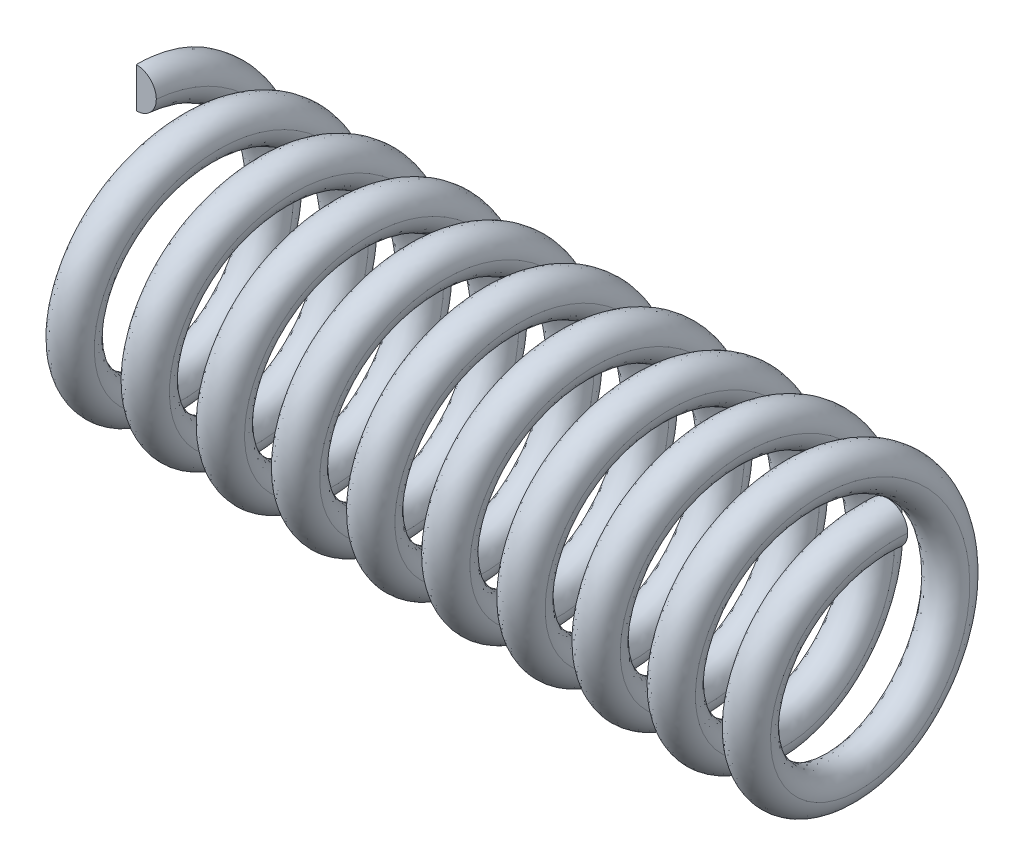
ISO-10303-21;
HEADER;
FILE_DESCRIPTION(('STEP AP214'),'2;1');
FILE_NAME('part.step','',(''),(''),'','','');
FILE_SCHEMA(('AUTOMOTIVE_DESIGN { 1 0 10303 214 1 1 1 1 }'));
ENDSEC;
DATA;
#1=APPLICATION_CONTEXT('core data for automotive mechanical design processes');
#2=APPLICATION_PROTOCOL_DEFINITION('international standard','automotive_design',2000,#1);
#3=PRODUCT_CONTEXT('',#1,'mechanical');
#4=PRODUCT('Part','Part','',(#3));
#5=PRODUCT_RELATED_PRODUCT_CATEGORY('part','',(#4));
#6=PRODUCT_DEFINITION_FORMATION('','',#4);
#7=PRODUCT_DEFINITION_CONTEXT('part definition',#1,'design');
#8=PRODUCT_DEFINITION('design','',#6,#7);
#9=PRODUCT_DEFINITION_SHAPE('','',#8);
#10=(LENGTH_UNIT() NAMED_UNIT(*) SI_UNIT(.MILLI.,.METRE.));
#11=(NAMED_UNIT(*) PLANE_ANGLE_UNIT() SI_UNIT($,.RADIAN.));
#12=(NAMED_UNIT(*) SI_UNIT($,.STERADIAN.) SOLID_ANGLE_UNIT());
#13=UNCERTAINTY_MEASURE_WITH_UNIT(LENGTH_MEASURE(1.E-05),#10,'distance_accuracy_value','');
#14=(GEOMETRIC_REPRESENTATION_CONTEXT(3) GLOBAL_UNCERTAINTY_ASSIGNED_CONTEXT((#13)) GLOBAL_UNIT_ASSIGNED_CONTEXT((#10,
#11,#12)) REPRESENTATION_CONTEXT('',''));
#15=CARTESIAN_POINT('',(0.,0.,0.));
#16=DIRECTION('',(0.,0.,1.));
#17=DIRECTION('',(1.,0.,0.));
#18=AXIS2_PLACEMENT_3D('',#15,#16,#17);
#19=CARTESIAN_POINT('',(-45.779552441,7.9452,0.));
#20=DIRECTION('',(0.,0.,1.));
#21=DIRECTION('',(1.,0.,0.));
#22=AXIS2_PLACEMENT_3D('',#19,#20,#21);
#23=PLANE('',#22);
#24=CARTESIAN_POINT('',(-45.779552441,7.95,0.));
#25=CARTESIAN_POINT('',(-45.7570491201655,7.94998088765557,0.));
#26=CARTESIAN_POINT('',(-45.7345515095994,7.95189785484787,0.));
#27=CARTESIAN_POINT('',(-45.6902099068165,7.95946291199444,0.));
#28=CARTESIAN_POINT('',(-45.6683654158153,7.96510807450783,0.));
#29=CARTESIAN_POINT('',(-45.6259247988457,7.9799924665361,0.));
#30=CARTESIAN_POINT('',(-45.6053292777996,7.98923342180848,0.));
#31=CARTESIAN_POINT('',(-45.565985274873,8.01103901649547,0.));
#32=CARTESIAN_POINT('',(-45.5472364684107,8.02360307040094,0.));
#33=CARTESIAN_POINT('',(-45.5121124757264,8.05170180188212,0.));
#34=CARTESIAN_POINT('',(-45.4957375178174,8.06723676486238,0.));
#35=CARTESIAN_POINT('',(-45.4658283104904,8.10083553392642,0.));
#36=CARTESIAN_POINT('',(-45.4522940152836,8.11889929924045,0.));
#37=CARTESIAN_POINT('',(-45.4284467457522,8.15704631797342,0.));
#38=CARTESIAN_POINT('',(-45.4181347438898,8.17713017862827,0.));
#39=CARTESIAN_POINT('',(-45.4010342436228,8.21874012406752,0.));
#40=CARTESIAN_POINT('',(-45.3942436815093,8.24026535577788,0.));
#41=CARTESIAN_POINT('',(-45.3860663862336,8.27660192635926,0.));
#42=CARTESIAN_POINT('',(-45.3836251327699,8.29118468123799,0.));
#43=CARTESIAN_POINT('',(-45.3803683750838,8.32050958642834,0.));
#44=CARTESIAN_POINT('',(-45.3795505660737,8.33525148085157,0.));
#45=CARTESIAN_POINT('',(-45.379552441,8.35,0.));
#46=B_SPLINE_CURVE_WITH_KNOTS('',3,(#24,#25,#26,#27,#28,#29,#30,#31,#32,#33,#34,#35,#36,#37,#38,
#39,#40,#41,#42,#43,#44,#45),.UNSPECIFIED.,.F.,.F.,(4,2,2,2,2,2,2,2,2,2,4),(0.,
0.0674202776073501,0.134787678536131,0.202187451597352,0.269575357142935,0.33696973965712,
0.404363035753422,0.471776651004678,0.539150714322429,0.583423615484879,0.627633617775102),.UNSPECIFIED.);
#47=CARTESIAN_POINT('',(-45.779552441,7.95000000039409,0.));
#48=VERTEX_POINT('',#47);
#49=CARTESIAN_POINT('',(-45.379552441,8.35,0.));
#50=VERTEX_POINT('',#49);
#51=EDGE_CURVE('E59',#48,#50,#46,.T.);
#52=ORIENTED_EDGE('',*,*,#51,.T.);
#53=CARTESIAN_POINT('',(-45.379552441,8.35,0.));
#54=CARTESIAN_POINT('',(-45.3795333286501,8.37250332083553,0.));
#55=CARTESIAN_POINT('',(-45.3814502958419,8.39500093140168,0.));
#56=CARTESIAN_POINT('',(-45.3890153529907,8.43934253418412,0.));
#57=CARTESIAN_POINT('',(-45.3946605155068,8.46118702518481,0.));
#58=CARTESIAN_POINT('',(-45.4095449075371,8.50362764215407,0.));
#59=CARTESIAN_POINT('',(-45.4187858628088,8.52422316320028,0.));
#60=CARTESIAN_POINT('',(-45.4405914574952,8.56356716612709,0.));
#61=CARTESIAN_POINT('',(-45.4531555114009,8.58231597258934,0.));
#62=CARTESIAN_POINT('',(-45.4812542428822,8.61743996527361,0.));
#63=CARTESIAN_POINT('',(-45.4967892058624,8.63381492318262,0.));
#64=CARTESIAN_POINT('',(-45.5303879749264,8.66372413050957,0.));
#65=CARTESIAN_POINT('',(-45.5484517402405,8.67725842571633,0.));
#66=CARTESIAN_POINT('',(-45.5865987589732,8.70110569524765,0.));
#67=CARTESIAN_POINT('',(-45.6066826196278,8.71141769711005,0.));
#68=CARTESIAN_POINT('',(-45.6482925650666,8.72851819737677,0.));
#69=CARTESIAN_POINT('',(-45.6698177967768,8.73530875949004,0.));
#70=CARTESIAN_POINT('',(-45.706154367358,8.74348605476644,0.));
#71=CARTESIAN_POINT('',(-45.7207371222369,8.74592730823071,0.));
#72=CARTESIAN_POINT('',(-45.7500620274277,8.74918406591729,0.));
#73=CARTESIAN_POINT('',(-45.7648039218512,8.75000187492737,0.));
#74=CARTESIAN_POINT('',(-45.779552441,8.75,0.));
#75=B_SPLINE_CURVE_WITH_KNOTS('',3,(#53,#54,#55,#56,#57,#58,#59,#60,#61,#62,#63,#64,#65,#66,#67,
#68,#69,#70,#71,#72,#73,#74),.UNSPECIFIED.,.F.,.F.,(4,2,2,2,2,2,2,2,2,2,4),(0.,
0.0674202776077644,0.134787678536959,0.202187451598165,0.269575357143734,0.336969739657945,
0.404363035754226,0.471776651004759,0.539150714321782,0.583423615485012,0.627633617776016),.UNSPECIFIED.);
#76=CARTESIAN_POINT('',(-45.779552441,8.74999999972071,0.));
#77=VERTEX_POINT('',#76);
#78=EDGE_CURVE('E55',#50,#77,#75,.T.);
#79=ORIENTED_EDGE('',*,*,#78,.T.);
#80=DIRECTION('',(0.,-1.,0.));
#81=VECTOR('',#80,1.);
#82=CARTESIAN_POINT('',(-45.779552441,7.257248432,0.));
#83=LINE('',#82,#81);
#84=EDGE_CURVE('E66',#77,#48,#83,.T.);
#85=ORIENTED_EDGE('',*,*,#84,.T.);
#86=EDGE_LOOP('',(#52,#79,#85));
#87=FACE_BOUND('',#86,.T.);
#88=ADVANCED_FACE('F17',(#87),#23,.T.);
#89=CARTESIAN_POINT('',(-31.184352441,7.9452,0.));
#90=DIRECTION('',(0.,0.,1.));
#91=DIRECTION('',(1.,0.,0.));
#92=AXIS2_PLACEMENT_3D('',#89,#90,#91);
#93=PLANE('',#92);
#94=CARTESIAN_POINT('',(-30.379552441,8.35,0.));
#95=CARTESIAN_POINT('',(-30.3795333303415,8.32749727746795,0.));
#96=CARTESIAN_POINT('',(-30.3814501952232,8.30500025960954,0.));
#97=CARTESIAN_POINT('',(-30.3890150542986,8.26065862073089,0.));
#98=CARTESIAN_POINT('',(-30.3946603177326,8.23881353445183,0.));
#99=CARTESIAN_POINT('',(-30.4095449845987,8.19637214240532,0.));
#100=CARTESIAN_POINT('',(-30.4187860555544,8.17577642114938,0.));
#101=CARTESIAN_POINT('',(-30.4405917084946,8.13643244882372,0.));
#102=CARTESIAN_POINT('',(-30.4531556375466,8.1176838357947,0.));
#103=CARTESIAN_POINT('',(-30.4812443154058,8.08257247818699,0.));
#104=CARTESIAN_POINT('',(-30.4967672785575,8.06620830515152,0.));
#105=CARTESIAN_POINT('',(-30.5303621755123,8.03629513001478,0.));
#106=CARTESIAN_POINT('',(-30.5484376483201,8.02275010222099,0.));
#107=CARTESIAN_POINT('',(-30.5865803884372,7.99890607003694,0.));
#108=CARTESIAN_POINT('',(-30.6066448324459,7.98860254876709,0.));
#109=CARTESIAN_POINT('',(-30.6482473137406,7.97149569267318,0.));
#110=CARTESIAN_POINT('',(-30.6697873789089,7.96469728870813,0.));
#111=CARTESIAN_POINT('',(-30.7136696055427,7.95482348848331,0.));
#112=CARTESIAN_POINT('',(-30.7360104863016,7.95174239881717,0.));
#113=CARTESIAN_POINT('',(-30.7809301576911,7.94936951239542,0.));
#114=CARTESIAN_POINT('',(-30.8035092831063,7.95008404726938,0.));
#115=CARTESIAN_POINT('',(-30.8482264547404,7.95529684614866,0.));
#116=CARTESIAN_POINT('',(-30.8703645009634,7.95979511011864,0.));
#117=CARTESIAN_POINT('',(-30.9135338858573,7.97243677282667,0.));
#118=CARTESIAN_POINT('',(-30.934567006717,7.98057408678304,0.));
#119=CARTESIAN_POINT('',(-30.9750014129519,8.0002768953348,0.));
#120=CARTESIAN_POINT('',(-30.9944001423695,8.01184763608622,0.));
#121=CARTESIAN_POINT('',(-31.0309521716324,8.03806519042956,0.));
#122=CARTESIAN_POINT('',(-31.0481085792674,8.052707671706,0.));
#123=CARTESIAN_POINT('',(-31.0797440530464,8.08468589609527,0.));
#124=CARTESIAN_POINT('',(-31.0942193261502,8.10202539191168,0.));
#125=CARTESIAN_POINT('',(-31.1200326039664,8.13886422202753,0.));
#126=CARTESIAN_POINT('',(-31.1313749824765,8.15836049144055,0.));
#127=CARTESIAN_POINT('',(-31.15064316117,8.19900790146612,0.));
#128=CARTESIAN_POINT('',(-31.1585639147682,8.22016143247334,0.));
#129=CARTESIAN_POINT('',(-31.1707262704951,8.26347174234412,0.));
#130=CARTESIAN_POINT('',(-31.1749734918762,8.28562693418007,0.));
#131=CARTESIAN_POINT('',(-31.1788159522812,8.32193321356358,0.));
#132=CARTESIAN_POINT('',(-31.1795584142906,8.33597029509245,0.));
#133=CARTESIAN_POINT('',(-31.179552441,8.35,0.));
#134=B_SPLINE_CURVE_WITH_KNOTS('',3,(#94,#95,#96,#97,#98,#99,#100,#101,#102,#103,#104,#105,#106,
#107,#108,#109,#110,#111,#112,#113,#114,#115,#116,#117,#118,#119,#120,#121,#122,#123,#124,#125,
#126,#127,#128,#129,#130,#131,#132,#133),.UNSPECIFIED.,.F.,.F.,(4,2,2,2,2,2,2,2,2,2,2,2,2,2,2,2,
2,2,2,4),(0.,0.0674185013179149,0.134787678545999,0.202188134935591,0.269575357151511,
0.336922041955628,0.40436303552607,0.471709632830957,0.539150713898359,0.60648837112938,
0.673938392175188,0.741388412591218,0.808726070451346,0.876167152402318,0.943513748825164,
1.01095490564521,1.07830142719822,1.14574694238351,1.21308910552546,1.25517818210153),.UNSPECIFIED.);
#135=CARTESIAN_POINT('',(-30.379552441,8.35,0.));
#136=VERTEX_POINT('',#135);
#137=CARTESIAN_POINT('',(-31.179552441,8.35,0.));
#138=VERTEX_POINT('',#137);
#139=EDGE_CURVE('E112',#136,#138,#134,.T.);
#140=ORIENTED_EDGE('',*,*,#139,.T.);
#141=CARTESIAN_POINT('',(-31.179552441,8.35,0.));
#142=CARTESIAN_POINT('',(-31.1795715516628,8.37250272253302,0.));
#143=CARTESIAN_POINT('',(-31.1776546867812,8.39499974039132,0.));
#144=CARTESIAN_POINT('',(-31.1700898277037,8.43934137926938,0.));
#145=CARTESIAN_POINT('',(-31.1644445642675,8.46118646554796,0.));
#146=CARTESIAN_POINT('',(-31.1495598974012,8.50362785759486,0.));
#147=CARTESIAN_POINT('',(-31.1403188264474,8.52422357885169,0.));
#148=CARTESIAN_POINT('',(-31.1185131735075,8.56356755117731,0.));
#149=CARTESIAN_POINT('',(-31.1059492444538,8.58231616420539,0.));
#150=CARTESIAN_POINT('',(-31.0778605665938,8.61742752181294,0.));
#151=CARTESIAN_POINT('',(-31.0623376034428,8.63379169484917,0.));
#152=CARTESIAN_POINT('',(-31.0287427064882,8.66370486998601,0.));
#153=CARTESIAN_POINT('',(-31.01066723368,8.67724989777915,0.));
#154=CARTESIAN_POINT('',(-30.9725244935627,8.70109392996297,0.));
#155=CARTESIAN_POINT('',(-30.9524600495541,8.71139745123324,0.));
#156=CARTESIAN_POINT('',(-30.9108575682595,8.72850430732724,0.));
#157=CARTESIAN_POINT('',(-30.8893175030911,8.73530271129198,0.));
#158=CARTESIAN_POINT('',(-30.8454352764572,8.74517651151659,0.));
#159=CARTESIAN_POINT('',(-30.8230943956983,8.74825760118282,0.));
#160=CARTESIAN_POINT('',(-30.7781747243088,8.75063048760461,0.));
#161=CARTESIAN_POINT('',(-30.7555955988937,8.74991595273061,0.));
#162=CARTESIAN_POINT('',(-30.7108784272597,8.74470315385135,0.));
#163=CARTESIAN_POINT('',(-30.6887403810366,8.74020488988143,0.));
#164=CARTESIAN_POINT('',(-30.6455709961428,8.72756322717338,0.));
#165=CARTESIAN_POINT('',(-30.6245378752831,8.7194259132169,0.));
#166=CARTESIAN_POINT('',(-30.5841034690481,8.69972310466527,0.));
#167=CARTESIAN_POINT('',(-30.5647047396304,8.68815236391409,0.));
#168=CARTESIAN_POINT('',(-30.5281527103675,8.66193480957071,0.));
#169=CARTESIAN_POINT('',(-30.5109963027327,8.64729232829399,0.));
#170=CARTESIAN_POINT('',(-30.4793608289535,8.61531410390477,0.));
#171=CARTESIAN_POINT('',(-30.4648855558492,8.5979746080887,0.));
#172=CARTESIAN_POINT('',(-30.4390722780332,8.56113577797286,0.));
#173=CARTESIAN_POINT('',(-30.4277298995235,8.54163950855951,0.));
#174=CARTESIAN_POINT('',(-30.4084617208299,8.50099209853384,0.));
#175=CARTESIAN_POINT('',(-30.4005409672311,8.47983856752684,0.));
#176=CARTESIAN_POINT('',(-30.3883786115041,8.43652825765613,0.));
#177=CARTESIAN_POINT('',(-30.3841313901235,8.41437306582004,0.));
#178=CARTESIAN_POINT('',(-30.380288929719,8.37806678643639,0.));
#179=CARTESIAN_POINT('',(-30.3795464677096,8.3640297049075,0.));
#180=CARTESIAN_POINT('',(-30.379552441,8.35,0.));
#181=B_SPLINE_CURVE_WITH_KNOTS('',3,(#141,#142,#143,#144,#145,#146,#147,#148,#149,#150,#151,
#152,#153,#154,#155,#156,#157,#158,#159,#160,#161,#162,#163,#164,#165,#166,#167,#168,#169,#170,
#171,#172,#173,#174,#175,#176,#177,#178,#179,#180),.UNSPECIFIED.,.F.,.F.,(4,2,2,2,2,2,2,2,2,2,2,
2,2,2,2,2,2,2,2,4),(0.,0.0674185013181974,0.134787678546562,0.202188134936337,0.269575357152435,
0.336922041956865,0.404363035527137,0.471709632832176,0.539150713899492,0.606488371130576,
0.673938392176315,0.741388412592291,0.808726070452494,0.876167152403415,0.943513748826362,
1.01095490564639,1.07830142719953,1.14574694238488,1.21308910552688,1.25517818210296),.UNSPECIFIED.);
#182=EDGE_CURVE('E22',#138,#136,#181,.T.);
#183=ORIENTED_EDGE('',*,*,#182,.T.);
#184=EDGE_LOOP('',(#140,#183));
#185=FACE_BOUND('',#184,.T.);
#186=ADVANCED_FACE('F77',(#185),#93,.F.);
#187=CARTESIAN_POINT('',(-45.379552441,8.35,0.));
#188=CARTESIAN_POINT('',(-45.254552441,8.35,-1.356773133));
#189=CARTESIAN_POINT('',(-45.129552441,7.175,-2.035159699));
#190=CARTESIAN_POINT('',(-45.004552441,6.,-2.713546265));
#191=CARTESIAN_POINT('',(-44.879552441,4.825,-2.035159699));
#192=CARTESIAN_POINT('',(-44.754552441,3.65,-1.356773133));
#193=CARTESIAN_POINT('',(-44.629552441,3.65,0.));
#194=CARTESIAN_POINT('',(-44.504552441,3.65,1.356773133));
#195=CARTESIAN_POINT('',(-44.379552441,4.825,2.035159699));
#196=CARTESIAN_POINT('',(-44.254552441,6.,2.713546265));
#197=CARTESIAN_POINT('',(-44.129552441,7.175,2.035159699));
#198=CARTESIAN_POINT('',(-44.004552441,8.35,1.356773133));
#199=CARTESIAN_POINT('',(-43.879552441,8.35,0.));
#200=CARTESIAN_POINT('',(-43.754552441,8.35,-1.356773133));
#201=CARTESIAN_POINT('',(-43.629552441,7.175,-2.035159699));
#202=CARTESIAN_POINT('',(-43.504552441,6.,-2.713546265));
#203=CARTESIAN_POINT('',(-43.379552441,4.825,-2.035159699));
#204=CARTESIAN_POINT('',(-43.254552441,3.65,-1.356773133));
#205=CARTESIAN_POINT('',(-43.129552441,3.65,0.));
#206=CARTESIAN_POINT('',(-43.004552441,3.65,1.356773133));
#207=CARTESIAN_POINT('',(-42.879552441,4.825,2.035159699));
#208=CARTESIAN_POINT('',(-42.754552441,6.,2.713546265));
#209=CARTESIAN_POINT('',(-42.629552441,7.175,2.035159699));
#210=CARTESIAN_POINT('',(-42.504552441,8.35,1.356773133));
#211=CARTESIAN_POINT('',(-42.379552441,8.35,0.));
#212=CARTESIAN_POINT('',(-42.254552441,8.35,-1.356773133));
#213=CARTESIAN_POINT('',(-42.129552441,7.175,-2.035159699));
#214=CARTESIAN_POINT('',(-42.004552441,6.,-2.713546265));
#215=CARTESIAN_POINT('',(-41.879552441,4.825,-2.035159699));
#216=CARTESIAN_POINT('',(-41.754552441,3.65,-1.356773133));
#217=CARTESIAN_POINT('',(-41.629552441,3.65,0.));
#218=CARTESIAN_POINT('',(-41.504552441,3.65,1.356773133));
#219=CARTESIAN_POINT('',(-41.379552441,4.825,2.035159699));
#220=CARTESIAN_POINT('',(-41.254552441,6.,2.713546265));
#221=CARTESIAN_POINT('',(-41.129552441,7.175,2.035159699));
#222=CARTESIAN_POINT('',(-41.004552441,8.35,1.356773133));
#223=CARTESIAN_POINT('',(-40.879552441,8.35,0.));
#224=CARTESIAN_POINT('',(-40.754552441,8.35,-1.356773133));
#225=CARTESIAN_POINT('',(-40.629552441,7.175,-2.035159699));
#226=CARTESIAN_POINT('',(-40.504552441,6.,-2.713546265));
#227=CARTESIAN_POINT('',(-40.379552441,4.825,-2.035159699));
#228=CARTESIAN_POINT('',(-40.254552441,3.65,-1.356773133));
#229=CARTESIAN_POINT('',(-40.129552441,3.65,0.));
#230=CARTESIAN_POINT('',(-40.004552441,3.65,1.356773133));
#231=CARTESIAN_POINT('',(-39.879552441,4.825,2.035159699));
#232=CARTESIAN_POINT('',(-39.754552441,6.,2.713546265));
#233=CARTESIAN_POINT('',(-39.629552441,7.175,2.035159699));
#234=CARTESIAN_POINT('',(-39.504552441,8.35,1.356773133));
#235=CARTESIAN_POINT('',(-39.379552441,8.35,0.));
#236=CARTESIAN_POINT('',(-39.254552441,8.35,-1.356773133));
#237=CARTESIAN_POINT('',(-39.129552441,7.175,-2.035159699));
#238=CARTESIAN_POINT('',(-39.004552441,6.,-2.713546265));
#239=CARTESIAN_POINT('',(-38.879552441,4.825,-2.035159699));
#240=CARTESIAN_POINT('',(-38.754552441,3.65,-1.356773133));
#241=CARTESIAN_POINT('',(-38.629552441,3.65,0.));
#242=CARTESIAN_POINT('',(-38.504552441,3.65,1.356773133));
#243=CARTESIAN_POINT('',(-38.379552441,4.825,2.035159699));
#244=CARTESIAN_POINT('',(-38.254552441,6.,2.713546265));
#245=CARTESIAN_POINT('',(-38.129552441,7.175,2.035159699));
#246=CARTESIAN_POINT('',(-38.004552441,8.35,1.356773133));
#247=CARTESIAN_POINT('',(-37.879552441,8.35,0.));
#248=CARTESIAN_POINT('',(-37.754552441,8.35,-1.356773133));
#249=CARTESIAN_POINT('',(-37.629552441,7.175,-2.035159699));
#250=CARTESIAN_POINT('',(-37.504552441,6.,-2.713546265));
#251=CARTESIAN_POINT('',(-37.379552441,4.825,-2.035159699));
#252=CARTESIAN_POINT('',(-37.254552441,3.65,-1.356773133));
#253=CARTESIAN_POINT('',(-37.129552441,3.65,0.));
#254=CARTESIAN_POINT('',(-37.004552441,3.65,1.356773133));
#255=CARTESIAN_POINT('',(-36.879552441,4.825,2.035159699));
#256=CARTESIAN_POINT('',(-36.754552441,6.,2.713546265));
#257=CARTESIAN_POINT('',(-36.629552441,7.175,2.035159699));
#258=CARTESIAN_POINT('',(-36.504552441,8.35,1.356773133));
#259=CARTESIAN_POINT('',(-36.379552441,8.35,0.));
#260=CARTESIAN_POINT('',(-36.254552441,8.35,-1.356773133));
#261=CARTESIAN_POINT('',(-36.129552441,7.175,-2.035159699));
#262=CARTESIAN_POINT('',(-36.004552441,6.,-2.713546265));
#263=CARTESIAN_POINT('',(-35.879552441,4.825,-2.035159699));
#264=CARTESIAN_POINT('',(-35.754552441,3.65,-1.356773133));
#265=CARTESIAN_POINT('',(-35.629552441,3.65,0.));
#266=CARTESIAN_POINT('',(-35.504552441,3.65,1.356773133));
#267=CARTESIAN_POINT('',(-35.379552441,4.825,2.035159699));
#268=CARTESIAN_POINT('',(-35.254552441,6.,2.713546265));
#269=CARTESIAN_POINT('',(-35.129552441,7.175,2.035159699));
#270=CARTESIAN_POINT('',(-35.004552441,8.35,1.356773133));
#271=CARTESIAN_POINT('',(-34.879552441,8.35,0.));
#272=CARTESIAN_POINT('',(-34.754552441,8.35,-1.356773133));
#273=CARTESIAN_POINT('',(-34.629552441,7.175,-2.035159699));
#274=CARTESIAN_POINT('',(-34.504552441,6.,-2.713546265));
#275=CARTESIAN_POINT('',(-34.379552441,4.825,-2.035159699));
#276=CARTESIAN_POINT('',(-34.254552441,3.65,-1.356773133));
#277=CARTESIAN_POINT('',(-34.129552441,3.65,0.));
#278=CARTESIAN_POINT('',(-34.004552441,3.65,1.356773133));
#279=CARTESIAN_POINT('',(-33.879552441,4.825,2.035159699));
#280=CARTESIAN_POINT('',(-33.754552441,6.,2.713546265));
#281=CARTESIAN_POINT('',(-33.629552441,7.175,2.035159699));
#282=CARTESIAN_POINT('',(-33.504552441,8.35,1.356773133));
#283=CARTESIAN_POINT('',(-33.379552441,8.35,0.));
#284=CARTESIAN_POINT('',(-33.254552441,8.35,-1.356773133));
#285=CARTESIAN_POINT('',(-33.129552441,7.175,-2.035159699));
#286=CARTESIAN_POINT('',(-33.004552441,6.,-2.713546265));
#287=CARTESIAN_POINT('',(-32.879552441,4.825,-2.035159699));
#288=CARTESIAN_POINT('',(-32.754552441,3.65,-1.356773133));
#289=CARTESIAN_POINT('',(-32.629552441,3.65,0.));
#290=CARTESIAN_POINT('',(-32.504552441,3.65,1.356773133));
#291=CARTESIAN_POINT('',(-32.379552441,4.825,2.035159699));
#292=CARTESIAN_POINT('',(-32.254552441,6.,2.713546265));
#293=CARTESIAN_POINT('',(-32.129552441,7.175,2.035159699));
#294=CARTESIAN_POINT('',(-32.004552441,8.35,1.356773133));
#295=CARTESIAN_POINT('',(-31.879552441,8.35,0.));
#296=CARTESIAN_POINT('',(-31.754552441,8.35,-1.356773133));
#297=CARTESIAN_POINT('',(-31.629552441,7.175,-2.035159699));
#298=CARTESIAN_POINT('',(-31.504552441,6.,-2.713546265));
#299=CARTESIAN_POINT('',(-31.379552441,4.825,-2.035159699));
#300=CARTESIAN_POINT('',(-31.254552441,3.65,-1.356773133));
#301=CARTESIAN_POINT('',(-31.129552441,3.65,0.));
#302=CARTESIAN_POINT('',(-31.004552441,3.65,1.356773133));
#303=CARTESIAN_POINT('',(-30.879552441,4.825,2.035159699));
#304=CARTESIAN_POINT('',(-30.754552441,6.,2.713546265));
#305=CARTESIAN_POINT('',(-30.629552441,7.175,2.035159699));
#306=CARTESIAN_POINT('',(-30.504552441,8.35,1.356773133));
#307=CARTESIAN_POINT('',(-30.379552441,8.35,0.));
#308=CARTESIAN_POINT('',(-45.379552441,9.15,0.));
#309=CARTESIAN_POINT('',(-45.254552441,9.15,-1.818653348));
#310=CARTESIAN_POINT('',(-45.129552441,7.575,-2.727980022));
#311=CARTESIAN_POINT('',(-45.004552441,6.,-3.637306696));
#312=CARTESIAN_POINT('',(-44.879552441,4.425,-2.727980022));
#313=CARTESIAN_POINT('',(-44.754552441,2.85,-1.818653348));
#314=CARTESIAN_POINT('',(-44.629552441,2.85,0.));
#315=CARTESIAN_POINT('',(-44.504552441,2.85,1.818653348));
#316=CARTESIAN_POINT('',(-44.379552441,4.425,2.727980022));
#317=CARTESIAN_POINT('',(-44.254552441,6.,3.637306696));
#318=CARTESIAN_POINT('',(-44.129552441,7.575,2.727980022));
#319=CARTESIAN_POINT('',(-44.004552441,9.15,1.818653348));
#320=CARTESIAN_POINT('',(-43.879552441,9.15,0.));
#321=CARTESIAN_POINT('',(-43.754552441,9.15,-1.818653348));
#322=CARTESIAN_POINT('',(-43.629552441,7.575,-2.727980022));
#323=CARTESIAN_POINT('',(-43.504552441,6.,-3.637306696));
#324=CARTESIAN_POINT('',(-43.379552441,4.425,-2.727980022));
#325=CARTESIAN_POINT('',(-43.254552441,2.85,-1.818653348));
#326=CARTESIAN_POINT('',(-43.129552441,2.85,0.));
#327=CARTESIAN_POINT('',(-43.004552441,2.85,1.818653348));
#328=CARTESIAN_POINT('',(-42.879552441,4.425,2.727980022));
#329=CARTESIAN_POINT('',(-42.754552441,6.,3.637306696));
#330=CARTESIAN_POINT('',(-42.629552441,7.575,2.727980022));
#331=CARTESIAN_POINT('',(-42.504552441,9.15,1.818653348));
#332=CARTESIAN_POINT('',(-42.379552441,9.15,0.));
#333=CARTESIAN_POINT('',(-42.254552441,9.15,-1.818653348));
#334=CARTESIAN_POINT('',(-42.129552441,7.575,-2.727980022));
#335=CARTESIAN_POINT('',(-42.004552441,6.,-3.637306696));
#336=CARTESIAN_POINT('',(-41.879552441,4.425,-2.727980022));
#337=CARTESIAN_POINT('',(-41.754552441,2.85,-1.818653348));
#338=CARTESIAN_POINT('',(-41.629552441,2.85,0.));
#339=CARTESIAN_POINT('',(-41.504552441,2.85,1.818653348));
#340=CARTESIAN_POINT('',(-41.379552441,4.425,2.727980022));
#341=CARTESIAN_POINT('',(-41.254552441,6.,3.637306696));
#342=CARTESIAN_POINT('',(-41.129552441,7.575,2.727980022));
#343=CARTESIAN_POINT('',(-41.004552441,9.15,1.818653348));
#344=CARTESIAN_POINT('',(-40.879552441,9.15,0.));
#345=CARTESIAN_POINT('',(-40.754552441,9.15,-1.818653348));
#346=CARTESIAN_POINT('',(-40.629552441,7.575,-2.727980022));
#347=CARTESIAN_POINT('',(-40.504552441,6.,-3.637306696));
#348=CARTESIAN_POINT('',(-40.379552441,4.425,-2.727980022));
#349=CARTESIAN_POINT('',(-40.254552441,2.85,-1.818653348));
#350=CARTESIAN_POINT('',(-40.129552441,2.85,0.));
#351=CARTESIAN_POINT('',(-40.004552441,2.85,1.818653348));
#352=CARTESIAN_POINT('',(-39.879552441,4.425,2.727980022));
#353=CARTESIAN_POINT('',(-39.754552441,6.,3.637306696));
#354=CARTESIAN_POINT('',(-39.629552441,7.575,2.727980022));
#355=CARTESIAN_POINT('',(-39.504552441,9.15,1.818653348));
#356=CARTESIAN_POINT('',(-39.379552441,9.15,0.));
#357=CARTESIAN_POINT('',(-39.254552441,9.15,-1.818653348));
#358=CARTESIAN_POINT('',(-39.129552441,7.575,-2.727980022));
#359=CARTESIAN_POINT('',(-39.004552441,6.,-3.637306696));
#360=CARTESIAN_POINT('',(-38.879552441,4.425,-2.727980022));
#361=CARTESIAN_POINT('',(-38.754552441,2.85,-1.818653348));
#362=CARTESIAN_POINT('',(-38.629552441,2.85,0.));
#363=CARTESIAN_POINT('',(-38.504552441,2.85,1.818653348));
#364=CARTESIAN_POINT('',(-38.379552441,4.425,2.727980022));
#365=CARTESIAN_POINT('',(-38.254552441,6.,3.637306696));
#366=CARTESIAN_POINT('',(-38.129552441,7.575,2.727980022));
#367=CARTESIAN_POINT('',(-38.004552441,9.15,1.818653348));
#368=CARTESIAN_POINT('',(-37.879552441,9.15,0.));
#369=CARTESIAN_POINT('',(-37.754552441,9.15,-1.818653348));
#370=CARTESIAN_POINT('',(-37.629552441,7.575,-2.727980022));
#371=CARTESIAN_POINT('',(-37.504552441,6.,-3.637306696));
#372=CARTESIAN_POINT('',(-37.379552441,4.425,-2.727980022));
#373=CARTESIAN_POINT('',(-37.254552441,2.85,-1.818653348));
#374=CARTESIAN_POINT('',(-37.129552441,2.85,0.));
#375=CARTESIAN_POINT('',(-37.004552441,2.85,1.818653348));
#376=CARTESIAN_POINT('',(-36.879552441,4.425,2.727980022));
#377=CARTESIAN_POINT('',(-36.754552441,6.,3.637306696));
#378=CARTESIAN_POINT('',(-36.629552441,7.575,2.727980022));
#379=CARTESIAN_POINT('',(-36.504552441,9.15,1.818653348));
#380=CARTESIAN_POINT('',(-36.379552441,9.15,0.));
#381=CARTESIAN_POINT('',(-36.254552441,9.15,-1.818653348));
#382=CARTESIAN_POINT('',(-36.129552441,7.575,-2.727980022));
#383=CARTESIAN_POINT('',(-36.004552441,6.,-3.637306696));
#384=CARTESIAN_POINT('',(-35.879552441,4.425,-2.727980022));
#385=CARTESIAN_POINT('',(-35.754552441,2.85,-1.818653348));
#386=CARTESIAN_POINT('',(-35.629552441,2.85,0.));
#387=CARTESIAN_POINT('',(-35.504552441,2.85,1.818653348));
#388=CARTESIAN_POINT('',(-35.379552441,4.425,2.727980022));
#389=CARTESIAN_POINT('',(-35.254552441,6.,3.637306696));
#390=CARTESIAN_POINT('',(-35.129552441,7.575,2.727980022));
#391=CARTESIAN_POINT('',(-35.004552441,9.15,1.818653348));
#392=CARTESIAN_POINT('',(-34.879552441,9.15,0.));
#393=CARTESIAN_POINT('',(-34.754552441,9.15,-1.818653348));
#394=CARTESIAN_POINT('',(-34.629552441,7.575,-2.727980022));
#395=CARTESIAN_POINT('',(-34.504552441,6.,-3.637306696));
#396=CARTESIAN_POINT('',(-34.379552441,4.425,-2.727980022));
#397=CARTESIAN_POINT('',(-34.254552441,2.85,-1.818653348));
#398=CARTESIAN_POINT('',(-34.129552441,2.85,0.));
#399=CARTESIAN_POINT('',(-34.004552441,2.85,1.818653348));
#400=CARTESIAN_POINT('',(-33.879552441,4.425,2.727980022));
#401=CARTESIAN_POINT('',(-33.754552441,6.,3.637306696));
#402=CARTESIAN_POINT('',(-33.629552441,7.575,2.727980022));
#403=CARTESIAN_POINT('',(-33.504552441,9.15,1.818653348));
#404=CARTESIAN_POINT('',(-33.379552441,9.15,0.));
#405=CARTESIAN_POINT('',(-33.254552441,9.15,-1.818653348));
#406=CARTESIAN_POINT('',(-33.129552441,7.575,-2.727980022));
#407=CARTESIAN_POINT('',(-33.004552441,6.,-3.637306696));
#408=CARTESIAN_POINT('',(-32.879552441,4.425,-2.727980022));
#409=CARTESIAN_POINT('',(-32.754552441,2.85,-1.818653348));
#410=CARTESIAN_POINT('',(-32.629552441,2.85,0.));
#411=CARTESIAN_POINT('',(-32.504552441,2.85,1.818653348));
#412=CARTESIAN_POINT('',(-32.379552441,4.425,2.727980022));
#413=CARTESIAN_POINT('',(-32.254552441,6.,3.637306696));
#414=CARTESIAN_POINT('',(-32.129552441,7.575,2.727980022));
#415=CARTESIAN_POINT('',(-32.004552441,9.15,1.818653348));
#416=CARTESIAN_POINT('',(-31.879552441,9.15,0.));
#417=CARTESIAN_POINT('',(-31.754552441,9.15,-1.818653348));
#418=CARTESIAN_POINT('',(-31.629552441,7.575,-2.727980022));
#419=CARTESIAN_POINT('',(-31.504552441,6.,-3.637306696));
#420=CARTESIAN_POINT('',(-31.379552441,4.425,-2.727980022));
#421=CARTESIAN_POINT('',(-31.254552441,2.85,-1.818653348));
#422=CARTESIAN_POINT('',(-31.129552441,2.85,0.));
#423=CARTESIAN_POINT('',(-31.004552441,2.85,1.818653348));
#424=CARTESIAN_POINT('',(-30.879552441,4.425,2.727980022));
#425=CARTESIAN_POINT('',(-30.754552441,6.,3.637306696));
#426=CARTESIAN_POINT('',(-30.629552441,7.575,2.727980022));
#427=CARTESIAN_POINT('',(-30.504552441,9.15,1.818653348));
#428=CARTESIAN_POINT('',(-30.379552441,9.15,0.));
#429=CARTESIAN_POINT('',(-46.179552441,9.15,0.));
#430=CARTESIAN_POINT('',(-46.054552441,9.15,-1.818653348));
#431=CARTESIAN_POINT('',(-45.929552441,7.575,-2.727980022));
#432=CARTESIAN_POINT('',(-45.804552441,6.,-3.637306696));
#433=CARTESIAN_POINT('',(-45.679552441,4.425,-2.727980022));
#434=CARTESIAN_POINT('',(-45.554552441,2.85,-1.818653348));
#435=CARTESIAN_POINT('',(-45.429552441,2.85,0.));
#436=CARTESIAN_POINT('',(-45.304552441,2.85,1.818653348));
#437=CARTESIAN_POINT('',(-45.179552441,4.425,2.727980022));
#438=CARTESIAN_POINT('',(-45.054552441,6.,3.637306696));
#439=CARTESIAN_POINT('',(-44.929552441,7.575,2.727980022));
#440=CARTESIAN_POINT('',(-44.804552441,9.15,1.818653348));
#441=CARTESIAN_POINT('',(-44.679552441,9.15,0.));
#442=CARTESIAN_POINT('',(-44.554552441,9.15,-1.818653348));
#443=CARTESIAN_POINT('',(-44.429552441,7.575,-2.727980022));
#444=CARTESIAN_POINT('',(-44.304552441,6.,-3.637306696));
#445=CARTESIAN_POINT('',(-44.179552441,4.425,-2.727980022));
#446=CARTESIAN_POINT('',(-44.054552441,2.85,-1.818653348));
#447=CARTESIAN_POINT('',(-43.929552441,2.85,0.));
#448=CARTESIAN_POINT('',(-43.804552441,2.85,1.818653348));
#449=CARTESIAN_POINT('',(-43.679552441,4.425,2.727980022));
#450=CARTESIAN_POINT('',(-43.554552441,6.,3.637306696));
#451=CARTESIAN_POINT('',(-43.429552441,7.575,2.727980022));
#452=CARTESIAN_POINT('',(-43.304552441,9.15,1.818653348));
#453=CARTESIAN_POINT('',(-43.179552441,9.15,0.));
#454=CARTESIAN_POINT('',(-43.054552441,9.15,-1.818653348));
#455=CARTESIAN_POINT('',(-42.929552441,7.575,-2.727980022));
#456=CARTESIAN_POINT('',(-42.804552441,6.,-3.637306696));
#457=CARTESIAN_POINT('',(-42.679552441,4.425,-2.727980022));
#458=CARTESIAN_POINT('',(-42.554552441,2.85,-1.818653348));
#459=CARTESIAN_POINT('',(-42.429552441,2.85,0.));
#460=CARTESIAN_POINT('',(-42.304552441,2.85,1.818653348));
#461=CARTESIAN_POINT('',(-42.179552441,4.425,2.727980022));
#462=CARTESIAN_POINT('',(-42.054552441,6.,3.637306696));
#463=CARTESIAN_POINT('',(-41.929552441,7.575,2.727980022));
#464=CARTESIAN_POINT('',(-41.804552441,9.15,1.818653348));
#465=CARTESIAN_POINT('',(-41.679552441,9.15,0.));
#466=CARTESIAN_POINT('',(-41.554552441,9.15,-1.818653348));
#467=CARTESIAN_POINT('',(-41.429552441,7.575,-2.727980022));
#468=CARTESIAN_POINT('',(-41.304552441,6.,-3.637306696));
#469=CARTESIAN_POINT('',(-41.179552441,4.425,-2.727980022));
#470=CARTESIAN_POINT('',(-41.054552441,2.85,-1.818653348));
#471=CARTESIAN_POINT('',(-40.929552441,2.85,0.));
#472=CARTESIAN_POINT('',(-40.804552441,2.85,1.818653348));
#473=CARTESIAN_POINT('',(-40.679552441,4.425,2.727980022));
#474=CARTESIAN_POINT('',(-40.554552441,6.,3.637306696));
#475=CARTESIAN_POINT('',(-40.429552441,7.575,2.727980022));
#476=CARTESIAN_POINT('',(-40.304552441,9.15,1.818653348));
#477=CARTESIAN_POINT('',(-40.179552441,9.15,0.));
#478=CARTESIAN_POINT('',(-40.054552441,9.15,-1.818653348));
#479=CARTESIAN_POINT('',(-39.929552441,7.575,-2.727980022));
#480=CARTESIAN_POINT('',(-39.804552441,6.,-3.637306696));
#481=CARTESIAN_POINT('',(-39.679552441,4.425,-2.727980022));
#482=CARTESIAN_POINT('',(-39.554552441,2.85,-1.818653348));
#483=CARTESIAN_POINT('',(-39.429552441,2.85,0.));
#484=CARTESIAN_POINT('',(-39.304552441,2.85,1.818653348));
#485=CARTESIAN_POINT('',(-39.179552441,4.425,2.727980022));
#486=CARTESIAN_POINT('',(-39.054552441,6.,3.637306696));
#487=CARTESIAN_POINT('',(-38.929552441,7.575,2.727980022));
#488=CARTESIAN_POINT('',(-38.804552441,9.15,1.818653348));
#489=CARTESIAN_POINT('',(-38.679552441,9.15,0.));
#490=CARTESIAN_POINT('',(-38.554552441,9.15,-1.818653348));
#491=CARTESIAN_POINT('',(-38.429552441,7.575,-2.727980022));
#492=CARTESIAN_POINT('',(-38.304552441,6.,-3.637306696));
#493=CARTESIAN_POINT('',(-38.179552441,4.425,-2.727980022));
#494=CARTESIAN_POINT('',(-38.054552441,2.85,-1.818653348));
#495=CARTESIAN_POINT('',(-37.929552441,2.85,0.));
#496=CARTESIAN_POINT('',(-37.804552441,2.85,1.818653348));
#497=CARTESIAN_POINT('',(-37.679552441,4.425,2.727980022));
#498=CARTESIAN_POINT('',(-37.554552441,6.,3.637306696));
#499=CARTESIAN_POINT('',(-37.429552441,7.575,2.727980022));
#500=CARTESIAN_POINT('',(-37.304552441,9.15,1.818653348));
#501=CARTESIAN_POINT('',(-37.179552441,9.15,0.));
#502=CARTESIAN_POINT('',(-37.054552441,9.15,-1.818653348));
#503=CARTESIAN_POINT('',(-36.929552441,7.575,-2.727980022));
#504=CARTESIAN_POINT('',(-36.804552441,6.,-3.637306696));
#505=CARTESIAN_POINT('',(-36.679552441,4.425,-2.727980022));
#506=CARTESIAN_POINT('',(-36.554552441,2.85,-1.818653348));
#507=CARTESIAN_POINT('',(-36.429552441,2.85,0.));
#508=CARTESIAN_POINT('',(-36.304552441,2.85,1.818653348));
#509=CARTESIAN_POINT('',(-36.179552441,4.425,2.727980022));
#510=CARTESIAN_POINT('',(-36.054552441,6.,3.637306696));
#511=CARTESIAN_POINT('',(-35.929552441,7.575,2.727980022));
#512=CARTESIAN_POINT('',(-35.804552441,9.15,1.818653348));
#513=CARTESIAN_POINT('',(-35.679552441,9.15,0.));
#514=CARTESIAN_POINT('',(-35.554552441,9.15,-1.818653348));
#515=CARTESIAN_POINT('',(-35.429552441,7.575,-2.727980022));
#516=CARTESIAN_POINT('',(-35.304552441,6.,-3.637306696));
#517=CARTESIAN_POINT('',(-35.179552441,4.425,-2.727980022));
#518=CARTESIAN_POINT('',(-35.054552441,2.85,-1.818653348));
#519=CARTESIAN_POINT('',(-34.929552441,2.85,0.));
#520=CARTESIAN_POINT('',(-34.804552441,2.85,1.818653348));
#521=CARTESIAN_POINT('',(-34.679552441,4.425,2.727980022));
#522=CARTESIAN_POINT('',(-34.554552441,6.,3.637306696));
#523=CARTESIAN_POINT('',(-34.429552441,7.575,2.727980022));
#524=CARTESIAN_POINT('',(-34.304552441,9.15,1.818653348));
#525=CARTESIAN_POINT('',(-34.179552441,9.15,0.));
#526=CARTESIAN_POINT('',(-34.054552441,9.15,-1.818653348));
#527=CARTESIAN_POINT('',(-33.929552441,7.575,-2.727980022));
#528=CARTESIAN_POINT('',(-33.804552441,6.,-3.637306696));
#529=CARTESIAN_POINT('',(-33.679552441,4.425,-2.727980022));
#530=CARTESIAN_POINT('',(-33.554552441,2.85,-1.818653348));
#531=CARTESIAN_POINT('',(-33.429552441,2.85,0.));
#532=CARTESIAN_POINT('',(-33.304552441,2.85,1.818653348));
#533=CARTESIAN_POINT('',(-33.179552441,4.425,2.727980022));
#534=CARTESIAN_POINT('',(-33.054552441,6.,3.637306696));
#535=CARTESIAN_POINT('',(-32.929552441,7.575,2.727980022));
#536=CARTESIAN_POINT('',(-32.804552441,9.15,1.818653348));
#537=CARTESIAN_POINT('',(-32.679552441,9.15,0.));
#538=CARTESIAN_POINT('',(-32.554552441,9.15,-1.818653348));
#539=CARTESIAN_POINT('',(-32.429552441,7.575,-2.727980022));
#540=CARTESIAN_POINT('',(-32.304552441,6.,-3.637306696));
#541=CARTESIAN_POINT('',(-32.179552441,4.425,-2.727980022));
#542=CARTESIAN_POINT('',(-32.054552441,2.85,-1.818653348));
#543=CARTESIAN_POINT('',(-31.929552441,2.85,0.));
#544=CARTESIAN_POINT('',(-31.804552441,2.85,1.818653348));
#545=CARTESIAN_POINT('',(-31.679552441,4.425,2.727980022));
#546=CARTESIAN_POINT('',(-31.554552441,6.,3.637306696));
#547=CARTESIAN_POINT('',(-31.429552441,7.575,2.727980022));
#548=CARTESIAN_POINT('',(-31.304552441,9.15,1.818653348));
#549=CARTESIAN_POINT('',(-31.179552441,9.15,0.));
#550=CARTESIAN_POINT('',(-46.179552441,8.35,0.));
#551=CARTESIAN_POINT('',(-46.054552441,8.35,-1.356773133));
#552=CARTESIAN_POINT('',(-45.929552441,7.175,-2.035159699));
#553=CARTESIAN_POINT('',(-45.804552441,6.,-2.713546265));
#554=CARTESIAN_POINT('',(-45.679552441,4.825,-2.035159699));
#555=CARTESIAN_POINT('',(-45.554552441,3.65,-1.356773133));
#556=CARTESIAN_POINT('',(-45.429552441,3.65,0.));
#557=CARTESIAN_POINT('',(-45.304552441,3.65,1.356773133));
#558=CARTESIAN_POINT('',(-45.179552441,4.825,2.035159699));
#559=CARTESIAN_POINT('',(-45.054552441,6.,2.713546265));
#560=CARTESIAN_POINT('',(-44.929552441,7.175,2.035159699));
#561=CARTESIAN_POINT('',(-44.804552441,8.35,1.356773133));
#562=CARTESIAN_POINT('',(-44.679552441,8.35,0.));
#563=CARTESIAN_POINT('',(-44.554552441,8.35,-1.356773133));
#564=CARTESIAN_POINT('',(-44.429552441,7.175,-2.035159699));
#565=CARTESIAN_POINT('',(-44.304552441,6.,-2.713546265));
#566=CARTESIAN_POINT('',(-44.179552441,4.825,-2.035159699));
#567=CARTESIAN_POINT('',(-44.054552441,3.65,-1.356773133));
#568=CARTESIAN_POINT('',(-43.929552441,3.65,0.));
#569=CARTESIAN_POINT('',(-43.804552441,3.65,1.356773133));
#570=CARTESIAN_POINT('',(-43.679552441,4.825,2.035159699));
#571=CARTESIAN_POINT('',(-43.554552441,6.,2.713546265));
#572=CARTESIAN_POINT('',(-43.429552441,7.175,2.035159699));
#573=CARTESIAN_POINT('',(-43.304552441,8.35,1.356773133));
#574=CARTESIAN_POINT('',(-43.179552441,8.35,0.));
#575=CARTESIAN_POINT('',(-43.054552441,8.35,-1.356773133));
#576=CARTESIAN_POINT('',(-42.929552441,7.175,-2.035159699));
#577=CARTESIAN_POINT('',(-42.804552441,6.,-2.713546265));
#578=CARTESIAN_POINT('',(-42.679552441,4.825,-2.035159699));
#579=CARTESIAN_POINT('',(-42.554552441,3.65,-1.356773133));
#580=CARTESIAN_POINT('',(-42.429552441,3.65,0.));
#581=CARTESIAN_POINT('',(-42.304552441,3.65,1.356773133));
#582=CARTESIAN_POINT('',(-42.179552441,4.825,2.035159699));
#583=CARTESIAN_POINT('',(-42.054552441,6.,2.713546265));
#584=CARTESIAN_POINT('',(-41.929552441,7.175,2.035159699));
#585=CARTESIAN_POINT('',(-41.804552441,8.35,1.356773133));
#586=CARTESIAN_POINT('',(-41.679552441,8.35,0.));
#587=CARTESIAN_POINT('',(-41.554552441,8.35,-1.356773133));
#588=CARTESIAN_POINT('',(-41.429552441,7.175,-2.035159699));
#589=CARTESIAN_POINT('',(-41.304552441,6.,-2.713546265));
#590=CARTESIAN_POINT('',(-41.179552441,4.825,-2.035159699));
#591=CARTESIAN_POINT('',(-41.054552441,3.65,-1.356773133));
#592=CARTESIAN_POINT('',(-40.929552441,3.65,0.));
#593=CARTESIAN_POINT('',(-40.804552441,3.65,1.356773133));
#594=CARTESIAN_POINT('',(-40.679552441,4.825,2.035159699));
#595=CARTESIAN_POINT('',(-40.554552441,6.,2.713546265));
#596=CARTESIAN_POINT('',(-40.429552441,7.175,2.035159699));
#597=CARTESIAN_POINT('',(-40.304552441,8.35,1.356773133));
#598=CARTESIAN_POINT('',(-40.179552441,8.35,0.));
#599=CARTESIAN_POINT('',(-40.054552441,8.35,-1.356773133));
#600=CARTESIAN_POINT('',(-39.929552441,7.175,-2.035159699));
#601=CARTESIAN_POINT('',(-39.804552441,6.,-2.713546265));
#602=CARTESIAN_POINT('',(-39.679552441,4.825,-2.035159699));
#603=CARTESIAN_POINT('',(-39.554552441,3.65,-1.356773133));
#604=CARTESIAN_POINT('',(-39.429552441,3.65,0.));
#605=CARTESIAN_POINT('',(-39.304552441,3.65,1.356773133));
#606=CARTESIAN_POINT('',(-39.179552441,4.825,2.035159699));
#607=CARTESIAN_POINT('',(-39.054552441,6.,2.713546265));
#608=CARTESIAN_POINT('',(-38.929552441,7.175,2.035159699));
#609=CARTESIAN_POINT('',(-38.804552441,8.35,1.356773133));
#610=CARTESIAN_POINT('',(-38.679552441,8.35,0.));
#611=CARTESIAN_POINT('',(-38.554552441,8.35,-1.356773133));
#612=CARTESIAN_POINT('',(-38.429552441,7.175,-2.035159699));
#613=CARTESIAN_POINT('',(-38.304552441,6.,-2.713546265));
#614=CARTESIAN_POINT('',(-38.179552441,4.825,-2.035159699));
#615=CARTESIAN_POINT('',(-38.054552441,3.65,-1.356773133));
#616=CARTESIAN_POINT('',(-37.929552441,3.65,0.));
#617=CARTESIAN_POINT('',(-37.804552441,3.65,1.356773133));
#618=CARTESIAN_POINT('',(-37.679552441,4.825,2.035159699));
#619=CARTESIAN_POINT('',(-37.554552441,6.,2.713546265));
#620=CARTESIAN_POINT('',(-37.429552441,7.175,2.035159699));
#621=CARTESIAN_POINT('',(-37.304552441,8.35,1.356773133));
#622=CARTESIAN_POINT('',(-37.179552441,8.35,0.));
#623=CARTESIAN_POINT('',(-37.054552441,8.35,-1.356773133));
#624=CARTESIAN_POINT('',(-36.929552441,7.175,-2.035159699));
#625=CARTESIAN_POINT('',(-36.804552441,6.,-2.713546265));
#626=CARTESIAN_POINT('',(-36.679552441,4.825,-2.035159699));
#627=CARTESIAN_POINT('',(-36.554552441,3.65,-1.356773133));
#628=CARTESIAN_POINT('',(-36.429552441,3.65,0.));
#629=CARTESIAN_POINT('',(-36.304552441,3.65,1.356773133));
#630=CARTESIAN_POINT('',(-36.179552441,4.825,2.035159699));
#631=CARTESIAN_POINT('',(-36.054552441,6.,2.713546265));
#632=CARTESIAN_POINT('',(-35.929552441,7.175,2.035159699));
#633=CARTESIAN_POINT('',(-35.804552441,8.35,1.356773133));
#634=CARTESIAN_POINT('',(-35.679552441,8.35,0.));
#635=CARTESIAN_POINT('',(-35.554552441,8.35,-1.356773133));
#636=CARTESIAN_POINT('',(-35.429552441,7.175,-2.035159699));
#637=CARTESIAN_POINT('',(-35.304552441,6.,-2.713546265));
#638=CARTESIAN_POINT('',(-35.179552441,4.825,-2.035159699));
#639=CARTESIAN_POINT('',(-35.054552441,3.65,-1.356773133));
#640=CARTESIAN_POINT('',(-34.929552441,3.65,0.));
#641=CARTESIAN_POINT('',(-34.804552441,3.65,1.356773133));
#642=CARTESIAN_POINT('',(-34.679552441,4.825,2.035159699));
#643=CARTESIAN_POINT('',(-34.554552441,6.,2.713546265));
#644=CARTESIAN_POINT('',(-34.429552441,7.175,2.035159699));
#645=CARTESIAN_POINT('',(-34.304552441,8.35,1.356773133));
#646=CARTESIAN_POINT('',(-34.179552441,8.35,0.));
#647=CARTESIAN_POINT('',(-34.054552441,8.35,-1.356773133));
#648=CARTESIAN_POINT('',(-33.929552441,7.175,-2.035159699));
#649=CARTESIAN_POINT('',(-33.804552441,6.,-2.713546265));
#650=CARTESIAN_POINT('',(-33.679552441,4.825,-2.035159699));
#651=CARTESIAN_POINT('',(-33.554552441,3.65,-1.356773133));
#652=CARTESIAN_POINT('',(-33.429552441,3.65,0.));
#653=CARTESIAN_POINT('',(-33.304552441,3.65,1.356773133));
#654=CARTESIAN_POINT('',(-33.179552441,4.825,2.035159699));
#655=CARTESIAN_POINT('',(-33.054552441,6.,2.713546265));
#656=CARTESIAN_POINT('',(-32.929552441,7.175,2.035159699));
#657=CARTESIAN_POINT('',(-32.804552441,8.35,1.356773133));
#658=CARTESIAN_POINT('',(-32.679552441,8.35,0.));
#659=CARTESIAN_POINT('',(-32.554552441,8.35,-1.356773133));
#660=CARTESIAN_POINT('',(-32.429552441,7.175,-2.035159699));
#661=CARTESIAN_POINT('',(-32.304552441,6.,-2.713546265));
#662=CARTESIAN_POINT('',(-32.179552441,4.825,-2.035159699));
#663=CARTESIAN_POINT('',(-32.054552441,3.65,-1.356773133));
#664=CARTESIAN_POINT('',(-31.929552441,3.65,0.));
#665=CARTESIAN_POINT('',(-31.804552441,3.65,1.356773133));
#666=CARTESIAN_POINT('',(-31.679552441,4.825,2.035159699));
#667=CARTESIAN_POINT('',(-31.554552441,6.,2.713546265));
#668=CARTESIAN_POINT('',(-31.429552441,7.175,2.035159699));
#669=CARTESIAN_POINT('',(-31.304552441,8.35,1.356773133));
#670=CARTESIAN_POINT('',(-31.179552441,8.35,0.));
#671=(BOUNDED_SURFACE() B_SPLINE_SURFACE(3,2,((#187,#188,#189,#190,#191,#192,#193,#194,#195,
#196,#197,#198,#199,#200,#201,#202,#203,#204,#205,#206,#207,#208,#209,#210,#211,#212,#213,#214,
#215,#216,#217,#218,#219,#220,#221,#222,#223,#224,#225,#226,#227,#228,#229,#230,#231,#232,#233,
#234,#235,#236,#237,#238,#239,#240,#241,#242,#243,#244,#245,#246,#247,#248,#249,#250,#251,#252,
#253,#254,#255,#256,#257,#258,#259,#260,#261,#262,#263,#264,#265,#266,#267,#268,#269,#270,#271,
#272,#273,#274,#275,#276,#277,#278,#279,#280,#281,#282,#283,#284,#285,#286,#287,#288,#289,#290,
#291,#292,#293,#294,#295,#296,#297,#298,#299,#300,#301,#302,#303,#304,#305,#306,#307),(#308,
#309,#310,#311,#312,#313,#314,#315,#316,#317,#318,#319,#320,#321,#322,#323,#324,#325,#326,#327,
#328,#329,#330,#331,#332,#333,#334,#335,#336,#337,#338,#339,#340,#341,#342,#343,#344,#345,#346,
#347,#348,#349,#350,#351,#352,#353,#354,#355,#356,#357,#358,#359,#360,#361,#362,#363,#364,#365,
#366,#367,#368,#369,#370,#371,#372,#373,#374,#375,#376,#377,#378,#379,#380,#381,#382,#383,#384,
#385,#386,#387,#388,#389,#390,#391,#392,#393,#394,#395,#396,#397,#398,#399,#400,#401,#402,#403,
#404,#405,#406,#407,#408,#409,#410,#411,#412,#413,#414,#415,#416,#417,#418,#419,#420,#421,#422,
#423,#424,#425,#426,#427,#428),(#429,#430,#431,#432,#433,#434,#435,#436,#437,#438,#439,#440,
#441,#442,#443,#444,#445,#446,#447,#448,#449,#450,#451,#452,#453,#454,#455,#456,#457,#458,#459,
#460,#461,#462,#463,#464,#465,#466,#467,#468,#469,#470,#471,#472,#473,#474,#475,#476,#477,#478,
#479,#480,#481,#482,#483,#484,#485,#486,#487,#488,#489,#490,#491,#492,#493,#494,#495,#496,#497,
#498,#499,#500,#501,#502,#503,#504,#505,#506,#507,#508,#509,#510,#511,#512,#513,#514,#515,#516,
#517,#518,#519,#520,#521,#522,#523,#524,#525,#526,#527,#528,#529,#530,#531,#532,#533,#534,#535,
#536,#537,#538,#539,#540,#541,#542,#543,#544,#545,#546,#547,#548,#549),(#550,#551,#552,#553,
#554,#555,#556,#557,#558,#559,#560,#561,#562,#563,#564,#565,#566,#567,#568,#569,#570,#571,#572,
#573,#574,#575,#576,#577,#578,#579,#580,#581,#582,#583,#584,#585,#586,#587,#588,#589,#590,#591,
#592,#593,#594,#595,#596,#597,#598,#599,#600,#601,#602,#603,#604,#605,#606,#607,#608,#609,#610,
#611,#612,#613,#614,#615,#616,#617,#618,#619,#620,#621,#622,#623,#624,#625,#626,#627,#628,#629,
#630,#631,#632,#633,#634,#635,#636,#637,#638,#639,#640,#641,#642,#643,#644,#645,#646,#647,#648,
#649,#650,#651,#652,#653,#654,#655,#656,#657,#658,#659,#660,#661,#662,#663,#664,#665,#666,#667,
#668,#669,#670)),.UNSPECIFIED.,.F.,.F.,.F.) B_SPLINE_SURFACE_WITH_KNOTS((4,4),(3,2,2,2,2,2,2,2,
2,2,2,2,2,2,2,2,2,2,2,2,2,2,2,2,2,2,2,2,2,2,2,2,2,2,2,2,2,2,2,2,2,2,2,2,2,2,2,2,2,2,2,2,2,2,2,2,
2,2,2,2,3),(0.,0.5),(0.,0.0151515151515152,0.0303030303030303,0.0454545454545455,
0.0606060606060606,0.0757575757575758,0.0909090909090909,0.106060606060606,0.121212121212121,
0.136363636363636,0.151515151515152,0.166666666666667,0.181818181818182,0.196969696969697,
0.212121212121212,0.227272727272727,0.242424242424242,0.257575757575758,0.272727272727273,
0.287878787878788,0.303030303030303,0.318181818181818,0.333333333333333,0.348484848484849,
0.363636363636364,0.378787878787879,0.393939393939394,0.409090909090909,0.424242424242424,
0.439393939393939,0.454545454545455,0.46969696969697,0.484848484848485,0.5,0.515151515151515,
0.53030303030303,0.545454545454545,0.560606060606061,0.575757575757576,0.590909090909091,
0.606060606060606,0.621212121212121,0.636363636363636,0.651515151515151,0.666666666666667,
0.681818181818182,0.696969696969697,0.712121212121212,0.727272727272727,0.742424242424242,
0.757575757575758,0.772727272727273,0.787878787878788,0.803030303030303,0.818181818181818,
0.833333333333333,0.848484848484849,0.863636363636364,0.878787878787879,0.893939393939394,
0.909090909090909),
.UNSPECIFIED.) GEOMETRIC_REPRESENTATION_ITEM() RATIONAL_B_SPLINE_SURFACE(((1.,0.866025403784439,
1.,0.866025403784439,1.,0.866025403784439,1.,0.866025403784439,1.,0.866025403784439,1.,
0.866025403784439,1.,0.866025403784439,1.,0.866025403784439,1.,0.866025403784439,1.,
0.866025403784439,1.,0.866025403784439,1.,0.866025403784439,1.,0.866025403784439,1.,
0.866025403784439,1.,0.866025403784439,1.,0.866025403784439,1.,0.866025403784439,1.,
0.866025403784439,1.,0.866025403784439,1.,0.866025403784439,1.,0.866025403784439,1.,
0.866025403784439,1.,0.866025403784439,1.,0.866025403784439,1.,0.866025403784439,1.,
0.866025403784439,1.,0.866025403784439,1.,0.866025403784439,1.,0.866025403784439,1.,
0.866025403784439,1.,0.866025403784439,1.,0.866025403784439,1.,0.866025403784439,1.,
0.866025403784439,1.,0.866025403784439,1.,0.866025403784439,1.,0.866025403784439,1.,
0.866025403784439,1.,0.866025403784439,1.,0.866025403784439,1.,0.866025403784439,1.,
0.866025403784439,1.,0.866025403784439,1.,0.866025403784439,1.,0.866025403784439,1.,
0.866025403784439,1.,0.866025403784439,1.,0.866025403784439,1.,0.866025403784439,1.,
0.866025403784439,1.,0.866025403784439,1.,0.866025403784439,1.,0.866025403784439,1.,
0.866025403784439,1.,0.866025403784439,1.,0.866025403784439,1.,0.866025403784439,1.,
0.866025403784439,1.,0.866025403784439,1.,0.866025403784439,1.),(0.333333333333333,
0.288675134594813,0.333333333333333,0.288675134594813,0.333333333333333,0.288675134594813,
0.333333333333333,0.288675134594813,0.333333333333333,0.288675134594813,0.333333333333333,
0.288675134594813,0.333333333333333,0.288675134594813,0.333333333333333,0.288675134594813,
0.333333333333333,0.288675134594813,0.333333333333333,0.288675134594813,0.333333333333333,
0.288675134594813,0.333333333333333,0.288675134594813,0.333333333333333,0.288675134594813,
0.333333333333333,0.288675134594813,0.333333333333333,0.288675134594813,0.333333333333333,
0.288675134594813,0.333333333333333,0.288675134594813,0.333333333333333,0.288675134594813,
0.333333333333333,0.288675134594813,0.333333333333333,0.288675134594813,0.333333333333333,
0.288675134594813,0.333333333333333,0.288675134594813,0.333333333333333,0.288675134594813,
0.333333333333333,0.288675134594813,0.333333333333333,0.288675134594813,0.333333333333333,
0.288675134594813,0.333333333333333,0.288675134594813,0.333333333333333,0.288675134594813,
0.333333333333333,0.288675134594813,0.333333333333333,0.288675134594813,0.333333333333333,
0.288675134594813,0.333333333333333,0.288675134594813,0.333333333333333,0.288675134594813,
0.333333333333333,0.288675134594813,0.333333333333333,0.288675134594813,0.333333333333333,
0.288675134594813,0.333333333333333,0.288675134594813,0.333333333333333,0.288675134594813,
0.333333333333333,0.288675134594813,0.333333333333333,0.288675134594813,0.333333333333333,
0.288675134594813,0.333333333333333,0.288675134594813,0.333333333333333,0.288675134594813,
0.333333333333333,0.288675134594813,0.333333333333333,0.288675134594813,0.333333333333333,
0.288675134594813,0.333333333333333,0.288675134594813,0.333333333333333,0.288675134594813,
0.333333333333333,0.288675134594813,0.333333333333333,0.288675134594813,0.333333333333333,
0.288675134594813,0.333333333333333,0.288675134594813,0.333333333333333,0.288675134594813,
0.333333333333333,0.288675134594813,0.333333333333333,0.288675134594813,0.333333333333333,
0.288675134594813,0.333333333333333,0.288675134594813,0.333333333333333,0.288675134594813,
0.333333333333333,0.288675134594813,0.333333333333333,0.288675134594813,0.333333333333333),
(0.333333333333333,0.288675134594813,0.333333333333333,0.288675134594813,0.333333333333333,
0.288675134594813,0.333333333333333,0.288675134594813,0.333333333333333,0.288675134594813,
0.333333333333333,0.288675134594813,0.333333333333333,0.288675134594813,0.333333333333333,
0.288675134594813,0.333333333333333,0.288675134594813,0.333333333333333,0.288675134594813,
0.333333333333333,0.288675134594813,0.333333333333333,0.288675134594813,0.333333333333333,
0.288675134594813,0.333333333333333,0.288675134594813,0.333333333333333,0.288675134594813,
0.333333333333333,0.288675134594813,0.333333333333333,0.288675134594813,0.333333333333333,
0.288675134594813,0.333333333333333,0.288675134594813,0.333333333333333,0.288675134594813,
0.333333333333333,0.288675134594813,0.333333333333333,0.288675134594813,0.333333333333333,
0.288675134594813,0.333333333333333,0.288675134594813,0.333333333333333,0.288675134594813,
0.333333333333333,0.288675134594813,0.333333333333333,0.288675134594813,0.333333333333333,
0.288675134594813,0.333333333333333,0.288675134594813,0.333333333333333,0.288675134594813,
0.333333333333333,0.288675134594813,0.333333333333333,0.288675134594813,0.333333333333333,
0.288675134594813,0.333333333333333,0.288675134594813,0.333333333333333,0.288675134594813,
0.333333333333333,0.288675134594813,0.333333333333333,0.288675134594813,0.333333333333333,
0.288675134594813,0.333333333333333,0.288675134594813,0.333333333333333,0.288675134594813,
0.333333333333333,0.288675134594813,0.333333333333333,0.288675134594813,0.333333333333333,
0.288675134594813,0.333333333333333,0.288675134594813,0.333333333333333,0.288675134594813,
0.333333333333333,0.288675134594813,0.333333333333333,0.288675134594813,0.333333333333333,
0.288675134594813,0.333333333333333,0.288675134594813,0.333333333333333,0.288675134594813,
0.333333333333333,0.288675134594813,0.333333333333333,0.288675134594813,0.333333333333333,
0.288675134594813,0.333333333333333,0.288675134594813,0.333333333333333,0.288675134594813,
0.333333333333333,0.288675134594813,0.333333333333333,0.288675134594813,0.333333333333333,
0.288675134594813,0.333333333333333,0.288675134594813,0.333333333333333,0.288675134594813,
0.333333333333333),(1.,0.866025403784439,1.,0.866025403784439,1.,0.866025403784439,1.,
0.866025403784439,1.,0.866025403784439,1.,0.866025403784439,1.,0.866025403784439,1.,
0.866025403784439,1.,0.866025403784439,1.,0.866025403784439,1.,0.866025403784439,1.,
0.866025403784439,1.,0.866025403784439,1.,0.866025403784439,1.,0.866025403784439,1.,
0.866025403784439,1.,0.866025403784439,1.,0.866025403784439,1.,0.866025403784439,1.,
0.866025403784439,1.,0.866025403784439,1.,0.866025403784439,1.,0.866025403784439,1.,
0.866025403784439,1.,0.866025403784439,1.,0.866025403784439,1.,0.866025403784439,1.,
0.866025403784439,1.,0.866025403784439,1.,0.866025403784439,1.,0.866025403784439,1.,
0.866025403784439,1.,0.866025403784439,1.,0.866025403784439,1.,0.866025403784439,1.,
0.866025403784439,1.,0.866025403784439,1.,0.866025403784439,1.,0.866025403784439,1.,
0.866025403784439,1.,0.866025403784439,1.,0.866025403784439,1.,0.866025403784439,1.,
0.866025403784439,1.,0.866025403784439,1.,0.866025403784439,1.,0.866025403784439,1.,
0.866025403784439,1.,0.866025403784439,1.,0.866025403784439,1.,0.866025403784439,1.,
0.866025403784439,1.,0.866025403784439,1.,0.866025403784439,1.,0.866025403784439,1.,
0.866025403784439,1.,0.866025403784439,1.,0.866025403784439,1.,0.866025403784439,1.,
0.866025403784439,1.))) REPRESENTATION_ITEM('') SURFACE());
#672=CARTESIAN_POINT('',(-45.779552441,5.76500000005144,-2.33822047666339));
#673=CARTESIAN_POINT('',(-45.7795524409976,5.7644454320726,-2.34341088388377));
#674=CARTESIAN_POINT('',(-45.7795524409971,5.76492933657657,-2.34851490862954));
#675=CARTESIAN_POINT('',(-45.7795524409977,5.76777405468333,-2.35981946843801));
#676=CARTESIAN_POINT('',(-45.7795524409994,5.77064401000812,-2.36590221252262));
#677=CARTESIAN_POINT('',(-45.7795524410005,5.77727851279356,-2.37643796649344));
#678=CARTESIAN_POINT('',(-45.7795524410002,5.78089754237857,-2.38099858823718));
#679=CARTESIAN_POINT('',(-45.7795524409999,5.78872635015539,-2.38959824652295));
#680=CARTESIAN_POINT('',(-45.779552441,5.79293750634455,-2.39363602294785));
#681=CARTESIAN_POINT('',(-45.7795524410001,5.80381523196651,-2.40311171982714));
#682=CARTESIAN_POINT('',(-45.779552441,5.81069479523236,-2.40829867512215));
#683=CARTESIAN_POINT('',(-45.779552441,5.8249042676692,-2.41802316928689));
#684=CARTESIAN_POINT('',(-45.779552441,5.83223502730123,-2.42255942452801));
#685=CARTESIAN_POINT('',(-45.779552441,5.85471279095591,-2.43545667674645));
#686=CARTESIAN_POINT('',(-45.779552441,5.87028867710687,-2.44306283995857));
#687=CARTESIAN_POINT('',(-45.779552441,5.91073459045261,-2.46076444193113));
#688=CARTESIAN_POINT('',(-45.779552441,5.9359986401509,-2.46992358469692));
#689=CARTESIAN_POINT('',(-45.779552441,5.98724764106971,-2.48604807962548));
#690=CARTESIAN_POINT('',(-45.779552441,6.01323397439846,-2.49300885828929));
#691=CARTESIAN_POINT('',(-45.779552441,6.06563332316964,-2.50515105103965));
#692=CARTESIAN_POINT('',(-45.779552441,6.0920466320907,-2.51033118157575));
#693=CARTESIAN_POINT('',(-45.779552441,6.14510120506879,-2.51914790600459));
#694=CARTESIAN_POINT('',(-45.779552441,6.1717422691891,-2.5227857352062));
#695=CARTESIAN_POINT('',(-45.779552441,6.24840016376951,-2.53124354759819));
#696=CARTESIAN_POINT('',(-45.779552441,6.29861341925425,-2.5343439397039));
#697=CARTESIAN_POINT('',(-45.779552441,6.39913249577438,-2.53631726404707));
#698=CARTESIAN_POINT('',(-45.779552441,6.44943835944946,-2.5351863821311));
#699=CARTESIAN_POINT('',(-45.779552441,6.59993860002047,-2.52596380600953));
#700=CARTESIAN_POINT('',(-45.779552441,6.69983880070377,-2.51205362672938));
#701=CARTESIAN_POINT('',(-45.779552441,6.84997409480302,-2.48033279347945));
#702=CARTESIAN_POINT('',(-45.779552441,6.90135020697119,-2.46747917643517));
#703=CARTESIAN_POINT('',(-45.779552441,7.0030674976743,-2.43812917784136));
#704=CARTESIAN_POINT('',(-45.779552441,7.05340864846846,-2.42163269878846));
#705=CARTESIAN_POINT('',(-45.779552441,7.15283598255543,-2.38517636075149));
#706=CARTESIAN_POINT('',(-45.779552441,7.2019217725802,-2.36521543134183));
#707=CARTESIAN_POINT('',(-45.779552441,7.29860295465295,-2.32198009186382));
#708=CARTESIAN_POINT('',(-45.779552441,7.34619813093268,-2.29870520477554));
#709=CARTESIAN_POINT('',(-45.779552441,7.5061179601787,-2.21415561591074));
#710=CARTESIAN_POINT('',(-45.779552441,7.61476091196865,-2.14570383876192));
#711=CARTESIAN_POINT('',(-45.779552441,7.82039542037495,-1.99313692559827));
#712=CARTESIAN_POINT('',(-45.779552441,7.91738231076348,-1.90901555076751));
#713=CARTESIAN_POINT('',(-45.779552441,8.10738357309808,-1.71717571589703));
#714=CARTESIAN_POINT('',(-45.779552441,8.1988206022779,-1.6078862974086));
#715=CARTESIAN_POINT('',(-45.779552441,8.3622788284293,-1.3755979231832));
#716=CARTESIAN_POINT('',(-45.779552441,8.43429154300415,-1.25259301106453));
#717=CARTESIAN_POINT('',(-45.779552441,8.55767128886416,-0.995078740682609));
#718=CARTESIAN_POINT('',(-45.779552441,8.6088158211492,-0.860463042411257));
#719=CARTESIAN_POINT('',(-45.779552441,8.68809437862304,-0.584720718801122));
#720=CARTESIAN_POINT('',(-45.779552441,8.71625654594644,-0.443602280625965));
#721=CARTESIAN_POINT('',(-45.779552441,8.73846969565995,-0.251252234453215));
#722=CARTESIAN_POINT('',(-45.779552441,8.74279880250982,-0.20105024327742));
#723=CARTESIAN_POINT('',(-45.779552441,8.74856004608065,-0.100572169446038));
#724=CARTESIAN_POINT('',(-45.779552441,8.74999746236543,-0.0502963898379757));
#725=CARTESIAN_POINT('',(-45.779552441,8.75,-1.31129432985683E-13));
#726=B_SPLINE_CURVE_WITH_KNOTS('',3,(#672,#673,#674,#675,#676,#677,#678,#679,#680,#681,#682,
#683,#684,#685,#686,#687,#688,#689,#690,#691,#692,#693,#694,#695,#696,#697,#698,#699,#700,#701,
#702,#703,#704,#705,#706,#707,#708,#709,#710,#711,#712,#713,#714,#715,#716,#717,#718,#719,#720,
#721,#722,#723,#724,#725),.UNSPECIFIED.,.F.,.F.,(4,2,2,2,2,2,2,2,2,2,2,2,2,2,2,2,2,2,2,2,2,2,2,
2,2,2,4),(0.,0.015268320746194,0.0350174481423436,0.052436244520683,0.0698962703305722,
0.0956856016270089,0.121525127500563,0.173415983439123,0.253886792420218,0.334523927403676,
0.415219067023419,0.495849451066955,0.646543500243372,0.797373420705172,1.09866610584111,
1.25744731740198,1.41623277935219,1.57506738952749,1.73392488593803,2.11751500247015,
2.50125817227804,2.92670753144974,3.35234238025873,3.78240373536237,4.21193768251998,
4.36304089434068,4.51386797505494),.UNSPECIFIED.);
#727=CARTESIAN_POINT('',(-45.779552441,5.76500000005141,-2.3382204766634));
#728=VERTEX_POINT('',#727);
#729=EDGE_CURVE('E41',#728,#77,#726,.T.);
#730=CARTESIAN_POINT('',(-45.379552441,8.35,0.));
#731=CARTESIAN_POINT('',(-45.254552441,8.35,-1.356773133));
#732=CARTESIAN_POINT('',(-45.129552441,7.175,-2.035159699));
#733=CARTESIAN_POINT('',(-45.004552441,6.,-2.713546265));
#734=CARTESIAN_POINT('',(-44.879552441,4.825,-2.035159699));
#735=CARTESIAN_POINT('',(-44.754552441,3.65,-1.356773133));
#736=CARTESIAN_POINT('',(-44.629552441,3.65,0.));
#737=CARTESIAN_POINT('',(-44.504552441,3.65,1.356773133));
#738=CARTESIAN_POINT('',(-44.379552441,4.825,2.035159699));
#739=CARTESIAN_POINT('',(-44.254552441,6.,2.713546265));
#740=CARTESIAN_POINT('',(-44.129552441,7.175,2.035159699));
#741=CARTESIAN_POINT('',(-44.004552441,8.35,1.356773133));
#742=CARTESIAN_POINT('',(-43.879552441,8.35,0.));
#743=CARTESIAN_POINT('',(-43.754552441,8.35,-1.356773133));
#744=CARTESIAN_POINT('',(-43.629552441,7.175,-2.035159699));
#745=CARTESIAN_POINT('',(-43.504552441,6.,-2.713546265));
#746=CARTESIAN_POINT('',(-43.379552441,4.825,-2.035159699));
#747=CARTESIAN_POINT('',(-43.254552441,3.65,-1.356773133));
#748=CARTESIAN_POINT('',(-43.129552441,3.65,0.));
#749=CARTESIAN_POINT('',(-43.004552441,3.65,1.356773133));
#750=CARTESIAN_POINT('',(-42.879552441,4.825,2.035159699));
#751=CARTESIAN_POINT('',(-42.754552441,6.,2.713546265));
#752=CARTESIAN_POINT('',(-42.629552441,7.175,2.035159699));
#753=CARTESIAN_POINT('',(-42.504552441,8.35,1.356773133));
#754=CARTESIAN_POINT('',(-42.379552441,8.35,0.));
#755=CARTESIAN_POINT('',(-42.254552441,8.35,-1.356773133));
#756=CARTESIAN_POINT('',(-42.129552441,7.175,-2.035159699));
#757=CARTESIAN_POINT('',(-42.004552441,6.,-2.713546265));
#758=CARTESIAN_POINT('',(-41.879552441,4.825,-2.035159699));
#759=CARTESIAN_POINT('',(-41.754552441,3.65,-1.356773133));
#760=CARTESIAN_POINT('',(-41.629552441,3.65,0.));
#761=CARTESIAN_POINT('',(-41.504552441,3.65,1.356773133));
#762=CARTESIAN_POINT('',(-41.379552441,4.825,2.035159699));
#763=CARTESIAN_POINT('',(-41.254552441,6.,2.713546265));
#764=CARTESIAN_POINT('',(-41.129552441,7.175,2.035159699));
#765=CARTESIAN_POINT('',(-41.004552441,8.35,1.356773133));
#766=CARTESIAN_POINT('',(-40.879552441,8.35,0.));
#767=CARTESIAN_POINT('',(-40.754552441,8.35,-1.356773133));
#768=CARTESIAN_POINT('',(-40.629552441,7.175,-2.035159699));
#769=CARTESIAN_POINT('',(-40.504552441,6.,-2.713546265));
#770=CARTESIAN_POINT('',(-40.379552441,4.825,-2.035159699));
#771=CARTESIAN_POINT('',(-40.254552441,3.65,-1.356773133));
#772=CARTESIAN_POINT('',(-40.129552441,3.65,0.));
#773=CARTESIAN_POINT('',(-40.004552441,3.65,1.356773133));
#774=CARTESIAN_POINT('',(-39.879552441,4.825,2.035159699));
#775=CARTESIAN_POINT('',(-39.754552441,6.,2.713546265));
#776=CARTESIAN_POINT('',(-39.629552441,7.175,2.035159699));
#777=CARTESIAN_POINT('',(-39.504552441,8.35,1.356773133));
#778=CARTESIAN_POINT('',(-39.379552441,8.35,0.));
#779=CARTESIAN_POINT('',(-39.254552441,8.35,-1.356773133));
#780=CARTESIAN_POINT('',(-39.129552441,7.175,-2.035159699));
#781=CARTESIAN_POINT('',(-39.004552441,6.,-2.713546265));
#782=CARTESIAN_POINT('',(-38.879552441,4.825,-2.035159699));
#783=CARTESIAN_POINT('',(-38.754552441,3.65,-1.356773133));
#784=CARTESIAN_POINT('',(-38.629552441,3.65,0.));
#785=CARTESIAN_POINT('',(-38.504552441,3.65,1.356773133));
#786=CARTESIAN_POINT('',(-38.379552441,4.825,2.035159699));
#787=CARTESIAN_POINT('',(-38.254552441,6.,2.713546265));
#788=CARTESIAN_POINT('',(-38.129552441,7.175,2.035159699));
#789=CARTESIAN_POINT('',(-38.004552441,8.35,1.356773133));
#790=CARTESIAN_POINT('',(-37.879552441,8.35,0.));
#791=CARTESIAN_POINT('',(-37.754552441,8.35,-1.356773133));
#792=CARTESIAN_POINT('',(-37.629552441,7.175,-2.035159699));
#793=CARTESIAN_POINT('',(-37.504552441,6.,-2.713546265));
#794=CARTESIAN_POINT('',(-37.379552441,4.825,-2.035159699));
#795=CARTESIAN_POINT('',(-37.254552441,3.65,-1.356773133));
#796=CARTESIAN_POINT('',(-37.129552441,3.65,0.));
#797=CARTESIAN_POINT('',(-37.004552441,3.65,1.356773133));
#798=CARTESIAN_POINT('',(-36.879552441,4.825,2.035159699));
#799=CARTESIAN_POINT('',(-36.754552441,6.,2.713546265));
#800=CARTESIAN_POINT('',(-36.629552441,7.175,2.035159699));
#801=CARTESIAN_POINT('',(-36.504552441,8.35,1.356773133));
#802=CARTESIAN_POINT('',(-36.379552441,8.35,0.));
#803=CARTESIAN_POINT('',(-36.254552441,8.35,-1.356773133));
#804=CARTESIAN_POINT('',(-36.129552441,7.175,-2.035159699));
#805=CARTESIAN_POINT('',(-36.004552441,6.,-2.713546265));
#806=CARTESIAN_POINT('',(-35.879552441,4.825,-2.035159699));
#807=CARTESIAN_POINT('',(-35.754552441,3.65,-1.356773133));
#808=CARTESIAN_POINT('',(-35.629552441,3.65,0.));
#809=CARTESIAN_POINT('',(-35.504552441,3.65,1.356773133));
#810=CARTESIAN_POINT('',(-35.379552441,4.825,2.035159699));
#811=CARTESIAN_POINT('',(-35.254552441,6.,2.713546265));
#812=CARTESIAN_POINT('',(-35.129552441,7.175,2.035159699));
#813=CARTESIAN_POINT('',(-35.004552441,8.35,1.356773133));
#814=CARTESIAN_POINT('',(-34.879552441,8.35,0.));
#815=CARTESIAN_POINT('',(-34.754552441,8.35,-1.356773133));
#816=CARTESIAN_POINT('',(-34.629552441,7.175,-2.035159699));
#817=CARTESIAN_POINT('',(-34.504552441,6.,-2.713546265));
#818=CARTESIAN_POINT('',(-34.379552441,4.825,-2.035159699));
#819=CARTESIAN_POINT('',(-34.254552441,3.65,-1.356773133));
#820=CARTESIAN_POINT('',(-34.129552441,3.65,0.));
#821=CARTESIAN_POINT('',(-34.004552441,3.65,1.356773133));
#822=CARTESIAN_POINT('',(-33.879552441,4.825,2.035159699));
#823=CARTESIAN_POINT('',(-33.754552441,6.,2.713546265));
#824=CARTESIAN_POINT('',(-33.629552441,7.175,2.035159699));
#825=CARTESIAN_POINT('',(-33.504552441,8.35,1.356773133));
#826=CARTESIAN_POINT('',(-33.379552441,8.35,0.));
#827=CARTESIAN_POINT('',(-33.254552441,8.35,-1.356773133));
#828=CARTESIAN_POINT('',(-33.129552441,7.175,-2.035159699));
#829=CARTESIAN_POINT('',(-33.004552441,6.,-2.713546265));
#830=CARTESIAN_POINT('',(-32.879552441,4.825,-2.035159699));
#831=CARTESIAN_POINT('',(-32.754552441,3.65,-1.356773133));
#832=CARTESIAN_POINT('',(-32.629552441,3.65,0.));
#833=CARTESIAN_POINT('',(-32.504552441,3.65,1.356773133));
#834=CARTESIAN_POINT('',(-32.379552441,4.825,2.035159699));
#835=CARTESIAN_POINT('',(-32.254552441,6.,2.713546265));
#836=CARTESIAN_POINT('',(-32.129552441,7.175,2.035159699));
#837=CARTESIAN_POINT('',(-32.004552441,8.35,1.356773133));
#838=CARTESIAN_POINT('',(-31.879552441,8.35,0.));
#839=CARTESIAN_POINT('',(-31.754552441,8.35,-1.356773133));
#840=CARTESIAN_POINT('',(-31.629552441,7.175,-2.035159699));
#841=CARTESIAN_POINT('',(-31.504552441,6.,-2.713546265));
#842=CARTESIAN_POINT('',(-31.379552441,4.825,-2.035159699));
#843=CARTESIAN_POINT('',(-31.254552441,3.65,-1.356773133));
#844=CARTESIAN_POINT('',(-31.129552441,3.65,0.));
#845=CARTESIAN_POINT('',(-31.004552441,3.65,1.356773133));
#846=CARTESIAN_POINT('',(-30.879552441,4.825,2.035159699));
#847=CARTESIAN_POINT('',(-30.754552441,6.,2.713546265));
#848=CARTESIAN_POINT('',(-30.629552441,7.175,2.035159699));
#849=CARTESIAN_POINT('',(-30.504552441,8.35,1.356773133));
#850=CARTESIAN_POINT('',(-30.379552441,8.35,0.));
#851=(BOUNDED_CURVE() B_SPLINE_CURVE(2,(#730,#731,#732,#733,#734,#735,#736,#737,#738,#739,#740,
#741,#742,#743,#744,#745,#746,#747,#748,#749,#750,#751,#752,#753,#754,#755,#756,#757,#758,#759,
#760,#761,#762,#763,#764,#765,#766,#767,#768,#769,#770,#771,#772,#773,#774,#775,#776,#777,#778,
#779,#780,#781,#782,#783,#784,#785,#786,#787,#788,#789,#790,#791,#792,#793,#794,#795,#796,#797,
#798,#799,#800,#801,#802,#803,#804,#805,#806,#807,#808,#809,#810,#811,#812,#813,#814,#815,#816,
#817,#818,#819,#820,#821,#822,#823,#824,#825,#826,#827,#828,#829,#830,#831,#832,#833,#834,#835,
#836,#837,#838,#839,#840,#841,#842,#843,#844,#845,#846,#847,#848,#849,#850),.UNSPECIFIED.,.F.,
.F.) B_SPLINE_CURVE_WITH_KNOTS((3,2,2,2,2,2,2,2,2,2,2,2,2,2,2,2,2,2,2,2,2,2,2,2,2,2,2,2,2,2,2,2,
2,2,2,2,2,2,2,2,2,2,2,2,2,2,2,2,2,2,2,2,2,2,2,2,2,2,2,2,3),(0.,0.0151515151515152,
0.0303030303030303,0.0454545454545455,0.0606060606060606,0.0757575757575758,0.0909090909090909,
0.106060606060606,0.121212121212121,0.136363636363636,0.151515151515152,0.166666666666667,
0.181818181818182,0.196969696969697,0.212121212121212,0.227272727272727,0.242424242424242,
0.257575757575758,0.272727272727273,0.287878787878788,0.303030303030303,0.318181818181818,
0.333333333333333,0.348484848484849,0.363636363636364,0.378787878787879,0.393939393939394,
0.409090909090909,0.424242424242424,0.439393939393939,0.454545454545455,0.46969696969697,
0.484848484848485,0.5,0.515151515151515,0.53030303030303,0.545454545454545,0.560606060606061,
0.575757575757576,0.590909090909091,0.606060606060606,0.621212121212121,0.636363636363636,
0.651515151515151,0.666666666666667,0.681818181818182,0.696969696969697,0.712121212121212,
0.727272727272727,0.742424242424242,0.757575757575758,0.772727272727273,0.787878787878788,
0.803030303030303,0.818181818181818,0.833333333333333,0.848484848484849,0.863636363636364,
0.878787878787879,0.893939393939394,0.909090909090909),
.UNSPECIFIED.) CURVE() GEOMETRIC_REPRESENTATION_ITEM() RATIONAL_B_SPLINE_CURVE((1.,
0.866025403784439,1.,0.866025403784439,1.,0.866025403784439,1.,0.866025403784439,1.,
0.866025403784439,1.,0.866025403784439,1.,0.866025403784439,1.,0.866025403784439,1.,
0.866025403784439,1.,0.866025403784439,1.,0.866025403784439,1.,0.866025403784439,1.,
0.866025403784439,1.,0.866025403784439,1.,0.866025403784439,1.,0.866025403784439,1.,
0.866025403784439,1.,0.866025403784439,1.,0.866025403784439,1.,0.866025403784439,1.,
0.866025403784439,1.,0.866025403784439,1.,0.866025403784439,1.,0.866025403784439,1.,
0.866025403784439,1.,0.866025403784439,1.,0.866025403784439,1.,0.866025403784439,1.,
0.866025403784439,1.,0.866025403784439,1.,0.866025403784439,1.,0.866025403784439,1.,
0.866025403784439,1.,0.866025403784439,1.,0.866025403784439,1.,0.866025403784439,1.,
0.866025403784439,1.,0.866025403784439,1.,0.866025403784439,1.,0.866025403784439,1.,
0.866025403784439,1.,0.866025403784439,1.,0.866025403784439,1.,0.866025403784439,1.,
0.866025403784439,1.,0.866025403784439,1.,0.866025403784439,1.,0.866025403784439,1.,
0.866025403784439,1.,0.866025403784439,1.,0.866025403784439,1.,0.866025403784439,1.,
0.866025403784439,1.,0.866025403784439,1.,0.866025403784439,1.,0.866025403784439,1.,
0.866025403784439,1.,0.866025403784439,1.,0.866025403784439,1.,0.866025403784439,1.)) REPRESENTATION_ITEM(''));
#852=EDGE_CURVE('E65',#50,#136,#851,.T.);
#853=CARTESIAN_POINT('',(-46.179552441,8.35,0.));
#854=CARTESIAN_POINT('',(-46.054552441,8.35,-1.356773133));
#855=CARTESIAN_POINT('',(-45.929552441,7.175,-2.035159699));
#856=CARTESIAN_POINT('',(-45.804552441,6.,-2.713546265));
#857=CARTESIAN_POINT('',(-45.679552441,4.825,-2.035159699));
#858=CARTESIAN_POINT('',(-45.554552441,3.65,-1.356773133));
#859=CARTESIAN_POINT('',(-45.429552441,3.65,0.));
#860=CARTESIAN_POINT('',(-45.304552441,3.65,1.356773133));
#861=CARTESIAN_POINT('',(-45.179552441,4.825,2.035159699));
#862=CARTESIAN_POINT('',(-45.054552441,6.,2.713546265));
#863=CARTESIAN_POINT('',(-44.929552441,7.175,2.035159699));
#864=CARTESIAN_POINT('',(-44.804552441,8.35,1.356773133));
#865=CARTESIAN_POINT('',(-44.679552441,8.35,0.));
#866=CARTESIAN_POINT('',(-44.554552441,8.35,-1.356773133));
#867=CARTESIAN_POINT('',(-44.429552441,7.175,-2.035159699));
#868=CARTESIAN_POINT('',(-44.304552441,6.,-2.713546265));
#869=CARTESIAN_POINT('',(-44.179552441,4.825,-2.035159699));
#870=CARTESIAN_POINT('',(-44.054552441,3.65,-1.356773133));
#871=CARTESIAN_POINT('',(-43.929552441,3.65,0.));
#872=CARTESIAN_POINT('',(-43.804552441,3.65,1.356773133));
#873=CARTESIAN_POINT('',(-43.679552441,4.825,2.035159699));
#874=CARTESIAN_POINT('',(-43.554552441,6.,2.713546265));
#875=CARTESIAN_POINT('',(-43.429552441,7.175,2.035159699));
#876=CARTESIAN_POINT('',(-43.304552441,8.35,1.356773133));
#877=CARTESIAN_POINT('',(-43.179552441,8.35,0.));
#878=CARTESIAN_POINT('',(-43.054552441,8.35,-1.356773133));
#879=CARTESIAN_POINT('',(-42.929552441,7.175,-2.035159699));
#880=CARTESIAN_POINT('',(-42.804552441,6.,-2.713546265));
#881=CARTESIAN_POINT('',(-42.679552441,4.825,-2.035159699));
#882=CARTESIAN_POINT('',(-42.554552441,3.65,-1.356773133));
#883=CARTESIAN_POINT('',(-42.429552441,3.65,0.));
#884=CARTESIAN_POINT('',(-42.304552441,3.65,1.356773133));
#885=CARTESIAN_POINT('',(-42.179552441,4.825,2.035159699));
#886=CARTESIAN_POINT('',(-42.054552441,6.,2.713546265));
#887=CARTESIAN_POINT('',(-41.929552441,7.175,2.035159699));
#888=CARTESIAN_POINT('',(-41.804552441,8.35,1.356773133));
#889=CARTESIAN_POINT('',(-41.679552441,8.35,0.));
#890=CARTESIAN_POINT('',(-41.554552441,8.35,-1.356773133));
#891=CARTESIAN_POINT('',(-41.429552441,7.175,-2.035159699));
#892=CARTESIAN_POINT('',(-41.304552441,6.,-2.713546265));
#893=CARTESIAN_POINT('',(-41.179552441,4.825,-2.035159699));
#894=CARTESIAN_POINT('',(-41.054552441,3.65,-1.356773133));
#895=CARTESIAN_POINT('',(-40.929552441,3.65,0.));
#896=CARTESIAN_POINT('',(-40.804552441,3.65,1.356773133));
#897=CARTESIAN_POINT('',(-40.679552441,4.825,2.035159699));
#898=CARTESIAN_POINT('',(-40.554552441,6.,2.713546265));
#899=CARTESIAN_POINT('',(-40.429552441,7.175,2.035159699));
#900=CARTESIAN_POINT('',(-40.304552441,8.35,1.356773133));
#901=CARTESIAN_POINT('',(-40.179552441,8.35,0.));
#902=CARTESIAN_POINT('',(-40.054552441,8.35,-1.356773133));
#903=CARTESIAN_POINT('',(-39.929552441,7.175,-2.035159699));
#904=CARTESIAN_POINT('',(-39.804552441,6.,-2.713546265));
#905=CARTESIAN_POINT('',(-39.679552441,4.825,-2.035159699));
#906=CARTESIAN_POINT('',(-39.554552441,3.65,-1.356773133));
#907=CARTESIAN_POINT('',(-39.429552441,3.65,0.));
#908=CARTESIAN_POINT('',(-39.304552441,3.65,1.356773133));
#909=CARTESIAN_POINT('',(-39.179552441,4.825,2.035159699));
#910=CARTESIAN_POINT('',(-39.054552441,6.,2.713546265));
#911=CARTESIAN_POINT('',(-38.929552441,7.175,2.035159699));
#912=CARTESIAN_POINT('',(-38.804552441,8.35,1.356773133));
#913=CARTESIAN_POINT('',(-38.679552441,8.35,0.));
#914=CARTESIAN_POINT('',(-38.554552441,8.35,-1.356773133));
#915=CARTESIAN_POINT('',(-38.429552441,7.175,-2.035159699));
#916=CARTESIAN_POINT('',(-38.304552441,6.,-2.713546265));
#917=CARTESIAN_POINT('',(-38.179552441,4.825,-2.035159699));
#918=CARTESIAN_POINT('',(-38.054552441,3.65,-1.356773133));
#919=CARTESIAN_POINT('',(-37.929552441,3.65,0.));
#920=CARTESIAN_POINT('',(-37.804552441,3.65,1.356773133));
#921=CARTESIAN_POINT('',(-37.679552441,4.825,2.035159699));
#922=CARTESIAN_POINT('',(-37.554552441,6.,2.713546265));
#923=CARTESIAN_POINT('',(-37.429552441,7.175,2.035159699));
#924=CARTESIAN_POINT('',(-37.304552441,8.35,1.356773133));
#925=CARTESIAN_POINT('',(-37.179552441,8.35,0.));
#926=CARTESIAN_POINT('',(-37.054552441,8.35,-1.356773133));
#927=CARTESIAN_POINT('',(-36.929552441,7.175,-2.035159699));
#928=CARTESIAN_POINT('',(-36.804552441,6.,-2.713546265));
#929=CARTESIAN_POINT('',(-36.679552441,4.825,-2.035159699));
#930=CARTESIAN_POINT('',(-36.554552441,3.65,-1.356773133));
#931=CARTESIAN_POINT('',(-36.429552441,3.65,0.));
#932=CARTESIAN_POINT('',(-36.304552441,3.65,1.356773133));
#933=CARTESIAN_POINT('',(-36.179552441,4.825,2.035159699));
#934=CARTESIAN_POINT('',(-36.054552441,6.,2.713546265));
#935=CARTESIAN_POINT('',(-35.929552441,7.175,2.035159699));
#936=CARTESIAN_POINT('',(-35.804552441,8.35,1.356773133));
#937=CARTESIAN_POINT('',(-35.679552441,8.35,0.));
#938=CARTESIAN_POINT('',(-35.554552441,8.35,-1.356773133));
#939=CARTESIAN_POINT('',(-35.429552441,7.175,-2.035159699));
#940=CARTESIAN_POINT('',(-35.304552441,6.,-2.713546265));
#941=CARTESIAN_POINT('',(-35.179552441,4.825,-2.035159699));
#942=CARTESIAN_POINT('',(-35.054552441,3.65,-1.356773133));
#943=CARTESIAN_POINT('',(-34.929552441,3.65,0.));
#944=CARTESIAN_POINT('',(-34.804552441,3.65,1.356773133));
#945=CARTESIAN_POINT('',(-34.679552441,4.825,2.035159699));
#946=CARTESIAN_POINT('',(-34.554552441,6.,2.713546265));
#947=CARTESIAN_POINT('',(-34.429552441,7.175,2.035159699));
#948=CARTESIAN_POINT('',(-34.304552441,8.35,1.356773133));
#949=CARTESIAN_POINT('',(-34.179552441,8.35,0.));
#950=CARTESIAN_POINT('',(-34.054552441,8.35,-1.356773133));
#951=CARTESIAN_POINT('',(-33.929552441,7.175,-2.035159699));
#952=CARTESIAN_POINT('',(-33.804552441,6.,-2.713546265));
#953=CARTESIAN_POINT('',(-33.679552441,4.825,-2.035159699));
#954=CARTESIAN_POINT('',(-33.554552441,3.65,-1.356773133));
#955=CARTESIAN_POINT('',(-33.429552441,3.65,0.));
#956=CARTESIAN_POINT('',(-33.304552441,3.65,1.356773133));
#957=CARTESIAN_POINT('',(-33.179552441,4.825,2.035159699));
#958=CARTESIAN_POINT('',(-33.054552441,6.,2.713546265));
#959=CARTESIAN_POINT('',(-32.929552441,7.175,2.035159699));
#960=CARTESIAN_POINT('',(-32.804552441,8.35,1.356773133));
#961=CARTESIAN_POINT('',(-32.679552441,8.35,0.));
#962=CARTESIAN_POINT('',(-32.554552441,8.35,-1.356773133));
#963=CARTESIAN_POINT('',(-32.429552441,7.175,-2.035159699));
#964=CARTESIAN_POINT('',(-32.304552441,6.,-2.713546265));
#965=CARTESIAN_POINT('',(-32.179552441,4.825,-2.035159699));
#966=CARTESIAN_POINT('',(-32.054552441,3.65,-1.356773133));
#967=CARTESIAN_POINT('',(-31.929552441,3.65,0.));
#968=CARTESIAN_POINT('',(-31.804552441,3.65,1.356773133));
#969=CARTESIAN_POINT('',(-31.679552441,4.825,2.035159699));
#970=CARTESIAN_POINT('',(-31.554552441,6.,2.713546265));
#971=CARTESIAN_POINT('',(-31.429552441,7.175,2.035159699));
#972=CARTESIAN_POINT('',(-31.304552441,8.35,1.356773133));
#973=CARTESIAN_POINT('',(-31.179552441,8.35,0.));
#974=(BOUNDED_CURVE() B_SPLINE_CURVE(2,(#853,#854,#855,#856,#857,#858,#859,#860,#861,#862,#863,
#864,#865,#866,#867,#868,#869,#870,#871,#872,#873,#874,#875,#876,#877,#878,#879,#880,#881,#882,
#883,#884,#885,#886,#887,#888,#889,#890,#891,#892,#893,#894,#895,#896,#897,#898,#899,#900,#901,
#902,#903,#904,#905,#906,#907,#908,#909,#910,#911,#912,#913,#914,#915,#916,#917,#918,#919,#920,
#921,#922,#923,#924,#925,#926,#927,#928,#929,#930,#931,#932,#933,#934,#935,#936,#937,#938,#939,
#940,#941,#942,#943,#944,#945,#946,#947,#948,#949,#950,#951,#952,#953,#954,#955,#956,#957,#958,
#959,#960,#961,#962,#963,#964,#965,#966,#967,#968,#969,#970,#971,#972,#973),.UNSPECIFIED.,.F.,
.F.) B_SPLINE_CURVE_WITH_KNOTS((3,2,2,2,2,2,2,2,2,2,2,2,2,2,2,2,2,2,2,2,2,2,2,2,2,2,2,2,2,2,2,2,
2,2,2,2,2,2,2,2,2,2,2,2,2,2,2,2,2,2,2,2,2,2,2,2,2,2,2,2,3),(0.,0.0151515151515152,
0.0303030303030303,0.0454545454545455,0.0606060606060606,0.0757575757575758,0.0909090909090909,
0.106060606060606,0.121212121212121,0.136363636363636,0.151515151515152,0.166666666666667,
0.181818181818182,0.196969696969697,0.212121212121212,0.227272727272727,0.242424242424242,
0.257575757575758,0.272727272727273,0.287878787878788,0.303030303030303,0.318181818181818,
0.333333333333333,0.348484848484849,0.363636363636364,0.378787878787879,0.393939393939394,
0.409090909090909,0.424242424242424,0.439393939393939,0.454545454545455,0.46969696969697,
0.484848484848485,0.5,0.515151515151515,0.53030303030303,0.545454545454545,0.560606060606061,
0.575757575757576,0.590909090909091,0.606060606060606,0.621212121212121,0.636363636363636,
0.651515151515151,0.666666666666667,0.681818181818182,0.696969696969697,0.712121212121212,
0.727272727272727,0.742424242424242,0.757575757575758,0.772727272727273,0.787878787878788,
0.803030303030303,0.818181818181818,0.833333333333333,0.848484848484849,0.863636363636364,
0.878787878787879,0.893939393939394,0.909090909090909),
.UNSPECIFIED.) CURVE() GEOMETRIC_REPRESENTATION_ITEM() RATIONAL_B_SPLINE_CURVE((1.,
0.866025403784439,1.,0.866025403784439,1.,0.866025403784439,1.,0.866025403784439,1.,
0.866025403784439,1.,0.866025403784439,1.,0.866025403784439,1.,0.866025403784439,1.,
0.866025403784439,1.,0.866025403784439,1.,0.866025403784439,1.,0.866025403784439,1.,
0.866025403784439,1.,0.866025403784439,1.,0.866025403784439,1.,0.866025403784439,1.,
0.866025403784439,1.,0.866025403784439,1.,0.866025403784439,1.,0.866025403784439,1.,
0.866025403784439,1.,0.866025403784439,1.,0.866025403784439,1.,0.866025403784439,1.,
0.866025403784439,1.,0.866025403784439,1.,0.866025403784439,1.,0.866025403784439,1.,
0.866025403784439,1.,0.866025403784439,1.,0.866025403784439,1.,0.866025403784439,1.,
0.866025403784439,1.,0.866025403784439,1.,0.866025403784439,1.,0.866025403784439,1.,
0.866025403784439,1.,0.866025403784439,1.,0.866025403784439,1.,0.866025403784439,1.,
0.866025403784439,1.,0.866025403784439,1.,0.866025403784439,1.,0.866025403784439,1.,
0.866025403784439,1.,0.866025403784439,1.,0.866025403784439,1.,0.866025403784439,1.,
0.866025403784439,1.,0.866025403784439,1.,0.866025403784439,1.,0.866025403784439,1.,
0.866025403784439,1.,0.866025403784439,1.,0.866025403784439,1.,0.866025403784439,1.,
0.866025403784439,1.,0.866025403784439,1.,0.866025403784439,1.,0.866025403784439,1.)) REPRESENTATION_ITEM(''));
#975=EDGE_CURVE('E33',#138,#728,#974,.F.);
#976=ORIENTED_EDGE('',*,*,#729,.T.);
#977=ORIENTED_EDGE('',*,*,#78,.F.);
#978=ORIENTED_EDGE('',*,*,#852,.T.);
#979=ORIENTED_EDGE('',*,*,#182,.F.);
#980=ORIENTED_EDGE('',*,*,#975,.T.);
#981=EDGE_LOOP('',(#976,#977,#978,#979,#980));
#982=FACE_BOUND('',#981,.T.);
#983=ADVANCED_FACE('F70',(#982),#671,.F.);
#984=CARTESIAN_POINT('',(-45.779552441,5.746583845,0.));
#985=DIRECTION('',(1.,0.,0.));
#986=DIRECTION('',(0.,0.,-1.));
#987=AXIS2_PLACEMENT_3D('',#984,#985,#986);
#988=PLANE('',#987);
#989=ORIENTED_EDGE('',*,*,#729,.F.);
#990=CARTESIAN_POINT('',(-45.779552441,5.76500000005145,-2.33822047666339));
#991=CARTESIAN_POINT('',(-45.779552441,5.76559692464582,-2.33227417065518));
#992=CARTESIAN_POINT('',(-45.779552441,5.76742478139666,-2.32674289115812));
#993=CARTESIAN_POINT('',(-45.779552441,5.77352913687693,-2.31498402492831));
#994=CARTESIAN_POINT('',(-45.779552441,5.77836920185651,-2.30903292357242));
#995=CARTESIAN_POINT('',(-45.779552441,5.78705700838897,-2.30048485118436));
#996=CARTESIAN_POINT('',(-45.779552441,5.79057870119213,-2.29747449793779));
#997=CARTESIAN_POINT('',(-45.779552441,5.79789476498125,-2.29180174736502));
#998=CARTESIAN_POINT('',(-45.7795524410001,5.80168864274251,-2.28913874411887));
#999=CARTESIAN_POINT('',(-45.7795524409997,5.81336521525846,-2.28152305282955));
#1000=CARTESIAN_POINT('',(-45.7795524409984,5.82150441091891,-2.27697696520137));
#1001=CARTESIAN_POINT('',(-45.7795524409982,5.83879284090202,-2.268175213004));
#1002=CARTESIAN_POINT('',(-45.7795524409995,5.84796952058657,-2.26397592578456));
#1003=CARTESIAN_POINT('',(-45.7795524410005,5.86652896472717,-2.25605426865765));
#1004=CARTESIAN_POINT('',(-45.7795524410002,5.87591183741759,-2.25233215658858));
#1005=CARTESIAN_POINT('',(-45.7795524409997,5.90426926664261,-2.24161064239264));
#1006=CARTESIAN_POINT('',(-45.7795524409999,5.9234153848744,-2.23507297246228));
#1007=CARTESIAN_POINT('',(-45.7795524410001,5.96190595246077,-2.22252454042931));
#1008=CARTESIAN_POINT('',(-45.779552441,5.98125067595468,-2.21651466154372));
#1009=CARTESIAN_POINT('',(-45.779552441,6.01998224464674,-2.20472159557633));
#1010=CARTESIAN_POINT('',(-45.779552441,6.03936900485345,-2.19893812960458));
#1011=CARTESIAN_POINT('',(-45.779552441,6.09758826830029,-2.18159570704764));
#1012=CARTESIAN_POINT('',(-45.779552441,6.13642808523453,-2.17006020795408));
#1013=CARTESIAN_POINT('',(-45.779552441,6.21387764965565,-2.14624332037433));
#1014=CARTESIAN_POINT('',(-45.779552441,6.25248740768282,-2.133961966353));
#1015=CARTESIAN_POINT('',(-45.779552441,6.36775858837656,-2.09538224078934));
#1016=CARTESIAN_POINT('',(-45.779552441,6.44386074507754,-2.06734852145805));
#1017=CARTESIAN_POINT('',(-45.779552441,6.59327050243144,-2.00531627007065));
#1018=CARTESIAN_POINT('',(-45.7795524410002,6.6665880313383,-1.97134195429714));
#1019=CARTESIAN_POINT('',(-45.7795524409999,6.80986461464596,-1.89685670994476));
#1020=CARTESIAN_POINT('',(-45.7795524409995,6.87982311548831,-1.85634470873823));
#1021=CARTESIAN_POINT('',(-45.7795524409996,6.99976112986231,-1.77887501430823));
#1022=CARTESIAN_POINT('',(-45.7795524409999,7.05061357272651,-1.74326926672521));
#1023=CARTESIAN_POINT('',(-45.7795524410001,7.14905052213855,-1.66781538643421));
#1024=CARTESIAN_POINT('',(-45.779552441,7.19663640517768,-1.62796905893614));
#1025=CARTESIAN_POINT('',(-45.779552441,7.28832914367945,-1.54434284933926));
#1026=CARTESIAN_POINT('',(-45.779552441,7.33243112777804,-1.50055763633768));
#1027=CARTESIAN_POINT('',(-45.779552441,7.41676142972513,-1.40938203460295));
#1028=CARTESIAN_POINT('',(-45.779552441,7.45698877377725,-1.36199074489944));
#1029=CARTESIAN_POINT('',(-45.779552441,7.53328117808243,-1.26392826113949));
#1030=CARTESIAN_POINT('',(-45.779552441,7.56934432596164,-1.21325557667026));
#1031=CARTESIAN_POINT('',(-45.779552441,7.63700023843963,-1.10903484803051));
#1032=CARTESIAN_POINT('',(-45.779552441,7.66859336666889,-1.05548703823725));
#1033=CARTESIAN_POINT('',(-45.779552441,7.75626815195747,-0.891103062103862));
#1034=CARTESIAN_POINT('',(-45.779552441,7.8053362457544,-0.776409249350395));
#1035=CARTESIAN_POINT('',(-45.779552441,7.87892372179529,-0.552307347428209));
#1036=CARTESIAN_POINT('',(-45.779552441,7.9054311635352,-0.443546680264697));
#1037=CARTESIAN_POINT('',(-45.779552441,7.93208675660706,-0.27834372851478));
#1038=CARTESIAN_POINT('',(-45.779552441,7.93878776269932,-0.222903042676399));
#1039=CARTESIAN_POINT('',(-45.779552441,7.94774545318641,-0.111649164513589));
#1040=CARTESIAN_POINT('',(-45.779552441,7.9500009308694,-0.0558358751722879));
#1041=CARTESIAN_POINT('',(-45.779552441,7.95,0.));
#1042=B_SPLINE_CURVE_WITH_KNOTS('',3,(#990,#991,#992,#993,#994,#995,#996,#997,#998,#999,#1000,
#1001,#1002,#1003,#1004,#1005,#1006,#1007,#1008,#1009,#1010,#1011,#1012,#1013,#1014,#1015,#1016,
#1017,#1018,#1019,#1020,#1021,#1022,#1023,#1024,#1025,#1026,#1027,#1028,#1029,#1030,#1031,#1032,
#1033,#1034,#1035,#1036,#1037,#1038,#1039,#1040,#1041),.UNSPECIFIED.,.F.,.F.,(4,2,2,2,2,2,2,2,2,
2,2,2,2,2,2,2,2,2,2,2,2,2,2,2,2,4),(0.,0.0173619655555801,0.0398493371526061,0.0537562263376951,
0.0676385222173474,0.0955538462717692,0.125811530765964,0.156085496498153,0.216755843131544,
0.277525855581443,0.338218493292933,0.459765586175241,0.581307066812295,0.824393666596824,
1.06651151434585,1.30866912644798,1.49470933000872,1.68067065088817,1.86688755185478,
2.05315113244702,2.23949991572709,2.42583353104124,2.79806156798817,3.13246054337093,
3.29983425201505,3.46725338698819),.UNSPECIFIED.);
#1043=EDGE_CURVE('E11',#728,#48,#1042,.T.);
#1044=ORIENTED_EDGE('',*,*,#1043,.T.);
#1045=ORIENTED_EDGE('',*,*,#84,.F.);
#1046=EDGE_LOOP('',(#989,#1044,#1045));
#1047=FACE_BOUND('',#1046,.T.);
#1048=ADVANCED_FACE('F19',(#1047),#988,.F.);
#1049=CARTESIAN_POINT('',(-46.179552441,8.35,0.));
#1050=CARTESIAN_POINT('',(-46.054552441,8.35,-1.356773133));
#1051=CARTESIAN_POINT('',(-45.929552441,7.175,-2.035159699));
#1052=CARTESIAN_POINT('',(-45.804552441,6.,-2.713546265));
#1053=CARTESIAN_POINT('',(-45.679552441,4.825,-2.035159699));
#1054=CARTESIAN_POINT('',(-45.554552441,3.65,-1.356773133));
#1055=CARTESIAN_POINT('',(-45.429552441,3.65,0.));
#1056=CARTESIAN_POINT('',(-45.304552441,3.65,1.356773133));
#1057=CARTESIAN_POINT('',(-45.179552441,4.825,2.035159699));
#1058=CARTESIAN_POINT('',(-45.054552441,6.,2.713546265));
#1059=CARTESIAN_POINT('',(-44.929552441,7.175,2.035159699));
#1060=CARTESIAN_POINT('',(-44.804552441,8.35,1.356773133));
#1061=CARTESIAN_POINT('',(-44.679552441,8.35,0.));
#1062=CARTESIAN_POINT('',(-44.554552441,8.35,-1.356773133));
#1063=CARTESIAN_POINT('',(-44.429552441,7.175,-2.035159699));
#1064=CARTESIAN_POINT('',(-44.304552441,6.,-2.713546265));
#1065=CARTESIAN_POINT('',(-44.179552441,4.825,-2.035159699));
#1066=CARTESIAN_POINT('',(-44.054552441,3.65,-1.356773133));
#1067=CARTESIAN_POINT('',(-43.929552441,3.65,0.));
#1068=CARTESIAN_POINT('',(-43.804552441,3.65,1.356773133));
#1069=CARTESIAN_POINT('',(-43.679552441,4.825,2.035159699));
#1070=CARTESIAN_POINT('',(-43.554552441,6.,2.713546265));
#1071=CARTESIAN_POINT('',(-43.429552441,7.175,2.035159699));
#1072=CARTESIAN_POINT('',(-43.304552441,8.35,1.356773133));
#1073=CARTESIAN_POINT('',(-43.179552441,8.35,0.));
#1074=CARTESIAN_POINT('',(-43.054552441,8.35,-1.356773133));
#1075=CARTESIAN_POINT('',(-42.929552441,7.175,-2.035159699));
#1076=CARTESIAN_POINT('',(-42.804552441,6.,-2.713546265));
#1077=CARTESIAN_POINT('',(-42.679552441,4.825,-2.035159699));
#1078=CARTESIAN_POINT('',(-42.554552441,3.65,-1.356773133));
#1079=CARTESIAN_POINT('',(-42.429552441,3.65,0.));
#1080=CARTESIAN_POINT('',(-42.304552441,3.65,1.356773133));
#1081=CARTESIAN_POINT('',(-42.179552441,4.825,2.035159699));
#1082=CARTESIAN_POINT('',(-42.054552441,6.,2.713546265));
#1083=CARTESIAN_POINT('',(-41.929552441,7.175,2.035159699));
#1084=CARTESIAN_POINT('',(-41.804552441,8.35,1.356773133));
#1085=CARTESIAN_POINT('',(-41.679552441,8.35,0.));
#1086=CARTESIAN_POINT('',(-41.554552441,8.35,-1.356773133));
#1087=CARTESIAN_POINT('',(-41.429552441,7.175,-2.035159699));
#1088=CARTESIAN_POINT('',(-41.304552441,6.,-2.713546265));
#1089=CARTESIAN_POINT('',(-41.179552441,4.825,-2.035159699));
#1090=CARTESIAN_POINT('',(-41.054552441,3.65,-1.356773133));
#1091=CARTESIAN_POINT('',(-40.929552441,3.65,0.));
#1092=CARTESIAN_POINT('',(-40.804552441,3.65,1.356773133));
#1093=CARTESIAN_POINT('',(-40.679552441,4.825,2.035159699));
#1094=CARTESIAN_POINT('',(-40.554552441,6.,2.713546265));
#1095=CARTESIAN_POINT('',(-40.429552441,7.175,2.035159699));
#1096=CARTESIAN_POINT('',(-40.304552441,8.35,1.356773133));
#1097=CARTESIAN_POINT('',(-40.179552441,8.35,0.));
#1098=CARTESIAN_POINT('',(-40.054552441,8.35,-1.356773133));
#1099=CARTESIAN_POINT('',(-39.929552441,7.175,-2.035159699));
#1100=CARTESIAN_POINT('',(-39.804552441,6.,-2.713546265));
#1101=CARTESIAN_POINT('',(-39.679552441,4.825,-2.035159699));
#1102=CARTESIAN_POINT('',(-39.554552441,3.65,-1.356773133));
#1103=CARTESIAN_POINT('',(-39.429552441,3.65,0.));
#1104=CARTESIAN_POINT('',(-39.304552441,3.65,1.356773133));
#1105=CARTESIAN_POINT('',(-39.179552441,4.825,2.035159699));
#1106=CARTESIAN_POINT('',(-39.054552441,6.,2.713546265));
#1107=CARTESIAN_POINT('',(-38.929552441,7.175,2.035159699));
#1108=CARTESIAN_POINT('',(-38.804552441,8.35,1.356773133));
#1109=CARTESIAN_POINT('',(-38.679552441,8.35,0.));
#1110=CARTESIAN_POINT('',(-38.554552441,8.35,-1.356773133));
#1111=CARTESIAN_POINT('',(-38.429552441,7.175,-2.035159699));
#1112=CARTESIAN_POINT('',(-38.304552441,6.,-2.713546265));
#1113=CARTESIAN_POINT('',(-38.179552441,4.825,-2.035159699));
#1114=CARTESIAN_POINT('',(-38.054552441,3.65,-1.356773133));
#1115=CARTESIAN_POINT('',(-37.929552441,3.65,0.));
#1116=CARTESIAN_POINT('',(-37.804552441,3.65,1.356773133));
#1117=CARTESIAN_POINT('',(-37.679552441,4.825,2.035159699));
#1118=CARTESIAN_POINT('',(-37.554552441,6.,2.713546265));
#1119=CARTESIAN_POINT('',(-37.429552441,7.175,2.035159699));
#1120=CARTESIAN_POINT('',(-37.304552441,8.35,1.356773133));
#1121=CARTESIAN_POINT('',(-37.179552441,8.35,0.));
#1122=CARTESIAN_POINT('',(-37.054552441,8.35,-1.356773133));
#1123=CARTESIAN_POINT('',(-36.929552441,7.175,-2.035159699));
#1124=CARTESIAN_POINT('',(-36.804552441,6.,-2.713546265));
#1125=CARTESIAN_POINT('',(-36.679552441,4.825,-2.035159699));
#1126=CARTESIAN_POINT('',(-36.554552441,3.65,-1.356773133));
#1127=CARTESIAN_POINT('',(-36.429552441,3.65,0.));
#1128=CARTESIAN_POINT('',(-36.304552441,3.65,1.356773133));
#1129=CARTESIAN_POINT('',(-36.179552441,4.825,2.035159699));
#1130=CARTESIAN_POINT('',(-36.054552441,6.,2.713546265));
#1131=CARTESIAN_POINT('',(-35.929552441,7.175,2.035159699));
#1132=CARTESIAN_POINT('',(-35.804552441,8.35,1.356773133));
#1133=CARTESIAN_POINT('',(-35.679552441,8.35,0.));
#1134=CARTESIAN_POINT('',(-35.554552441,8.35,-1.356773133));
#1135=CARTESIAN_POINT('',(-35.429552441,7.175,-2.035159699));
#1136=CARTESIAN_POINT('',(-35.304552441,6.,-2.713546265));
#1137=CARTESIAN_POINT('',(-35.179552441,4.825,-2.035159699));
#1138=CARTESIAN_POINT('',(-35.054552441,3.65,-1.356773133));
#1139=CARTESIAN_POINT('',(-34.929552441,3.65,0.));
#1140=CARTESIAN_POINT('',(-34.804552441,3.65,1.356773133));
#1141=CARTESIAN_POINT('',(-34.679552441,4.825,2.035159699));
#1142=CARTESIAN_POINT('',(-34.554552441,6.,2.713546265));
#1143=CARTESIAN_POINT('',(-34.429552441,7.175,2.035159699));
#1144=CARTESIAN_POINT('',(-34.304552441,8.35,1.356773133));
#1145=CARTESIAN_POINT('',(-34.179552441,8.35,0.));
#1146=CARTESIAN_POINT('',(-34.054552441,8.35,-1.356773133));
#1147=CARTESIAN_POINT('',(-33.929552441,7.175,-2.035159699));
#1148=CARTESIAN_POINT('',(-33.804552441,6.,-2.713546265));
#1149=CARTESIAN_POINT('',(-33.679552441,4.825,-2.035159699));
#1150=CARTESIAN_POINT('',(-33.554552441,3.65,-1.356773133));
#1151=CARTESIAN_POINT('',(-33.429552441,3.65,0.));
#1152=CARTESIAN_POINT('',(-33.304552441,3.65,1.356773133));
#1153=CARTESIAN_POINT('',(-33.179552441,4.825,2.035159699));
#1154=CARTESIAN_POINT('',(-33.054552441,6.,2.713546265));
#1155=CARTESIAN_POINT('',(-32.929552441,7.175,2.035159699));
#1156=CARTESIAN_POINT('',(-32.804552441,8.35,1.356773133));
#1157=CARTESIAN_POINT('',(-32.679552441,8.35,0.));
#1158=CARTESIAN_POINT('',(-32.554552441,8.35,-1.356773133));
#1159=CARTESIAN_POINT('',(-32.429552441,7.175,-2.035159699));
#1160=CARTESIAN_POINT('',(-32.304552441,6.,-2.713546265));
#1161=CARTESIAN_POINT('',(-32.179552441,4.825,-2.035159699));
#1162=CARTESIAN_POINT('',(-32.054552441,3.65,-1.356773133));
#1163=CARTESIAN_POINT('',(-31.929552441,3.65,0.));
#1164=CARTESIAN_POINT('',(-31.804552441,3.65,1.356773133));
#1165=CARTESIAN_POINT('',(-31.679552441,4.825,2.035159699));
#1166=CARTESIAN_POINT('',(-31.554552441,6.,2.713546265));
#1167=CARTESIAN_POINT('',(-31.429552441,7.175,2.035159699));
#1168=CARTESIAN_POINT('',(-31.304552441,8.35,1.356773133));
#1169=CARTESIAN_POINT('',(-31.179552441,8.35,0.));
#1170=CARTESIAN_POINT('',(-46.179552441,7.55,0.));
#1171=CARTESIAN_POINT('',(-46.054552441,7.55,-0.894892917));
#1172=CARTESIAN_POINT('',(-45.929552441,6.775,-1.342339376));
#1173=CARTESIAN_POINT('',(-45.804552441,6.,-1.789785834));
#1174=CARTESIAN_POINT('',(-45.679552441,5.225,-1.342339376));
#1175=CARTESIAN_POINT('',(-45.554552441,4.45,-0.894892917));
#1176=CARTESIAN_POINT('',(-45.429552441,4.45,0.));
#1177=CARTESIAN_POINT('',(-45.304552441,4.45,0.894892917));
#1178=CARTESIAN_POINT('',(-45.179552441,5.225,1.342339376));
#1179=CARTESIAN_POINT('',(-45.054552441,6.,1.789785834));
#1180=CARTESIAN_POINT('',(-44.929552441,6.775,1.342339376));
#1181=CARTESIAN_POINT('',(-44.804552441,7.55,0.894892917));
#1182=CARTESIAN_POINT('',(-44.679552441,7.55,0.));
#1183=CARTESIAN_POINT('',(-44.554552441,7.55,-0.894892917));
#1184=CARTESIAN_POINT('',(-44.429552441,6.775,-1.342339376));
#1185=CARTESIAN_POINT('',(-44.304552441,6.,-1.789785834));
#1186=CARTESIAN_POINT('',(-44.179552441,5.225,-1.342339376));
#1187=CARTESIAN_POINT('',(-44.054552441,4.45,-0.894892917));
#1188=CARTESIAN_POINT('',(-43.929552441,4.45,0.));
#1189=CARTESIAN_POINT('',(-43.804552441,4.45,0.894892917));
#1190=CARTESIAN_POINT('',(-43.679552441,5.225,1.342339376));
#1191=CARTESIAN_POINT('',(-43.554552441,6.,1.789785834));
#1192=CARTESIAN_POINT('',(-43.429552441,6.775,1.342339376));
#1193=CARTESIAN_POINT('',(-43.304552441,7.55,0.894892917));
#1194=CARTESIAN_POINT('',(-43.179552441,7.55,0.));
#1195=CARTESIAN_POINT('',(-43.054552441,7.55,-0.894892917));
#1196=CARTESIAN_POINT('',(-42.929552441,6.775,-1.342339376));
#1197=CARTESIAN_POINT('',(-42.804552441,6.,-1.789785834));
#1198=CARTESIAN_POINT('',(-42.679552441,5.225,-1.342339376));
#1199=CARTESIAN_POINT('',(-42.554552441,4.45,-0.894892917));
#1200=CARTESIAN_POINT('',(-42.429552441,4.45,0.));
#1201=CARTESIAN_POINT('',(-42.304552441,4.45,0.894892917));
#1202=CARTESIAN_POINT('',(-42.179552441,5.225,1.342339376));
#1203=CARTESIAN_POINT('',(-42.054552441,6.,1.789785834));
#1204=CARTESIAN_POINT('',(-41.929552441,6.775,1.342339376));
#1205=CARTESIAN_POINT('',(-41.804552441,7.55,0.894892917));
#1206=CARTESIAN_POINT('',(-41.679552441,7.55,0.));
#1207=CARTESIAN_POINT('',(-41.554552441,7.55,-0.894892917));
#1208=CARTESIAN_POINT('',(-41.429552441,6.775,-1.342339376));
#1209=CARTESIAN_POINT('',(-41.304552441,6.,-1.789785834));
#1210=CARTESIAN_POINT('',(-41.179552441,5.225,-1.342339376));
#1211=CARTESIAN_POINT('',(-41.054552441,4.45,-0.894892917));
#1212=CARTESIAN_POINT('',(-40.929552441,4.45,0.));
#1213=CARTESIAN_POINT('',(-40.804552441,4.45,0.894892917));
#1214=CARTESIAN_POINT('',(-40.679552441,5.225,1.342339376));
#1215=CARTESIAN_POINT('',(-40.554552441,6.,1.789785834));
#1216=CARTESIAN_POINT('',(-40.429552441,6.775,1.342339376));
#1217=CARTESIAN_POINT('',(-40.304552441,7.55,0.894892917));
#1218=CARTESIAN_POINT('',(-40.179552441,7.55,0.));
#1219=CARTESIAN_POINT('',(-40.054552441,7.55,-0.894892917));
#1220=CARTESIAN_POINT('',(-39.929552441,6.775,-1.342339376));
#1221=CARTESIAN_POINT('',(-39.804552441,6.,-1.789785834));
#1222=CARTESIAN_POINT('',(-39.679552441,5.225,-1.342339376));
#1223=CARTESIAN_POINT('',(-39.554552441,4.45,-0.894892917));
#1224=CARTESIAN_POINT('',(-39.429552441,4.45,0.));
#1225=CARTESIAN_POINT('',(-39.304552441,4.45,0.894892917));
#1226=CARTESIAN_POINT('',(-39.179552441,5.225,1.342339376));
#1227=CARTESIAN_POINT('',(-39.054552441,6.,1.789785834));
#1228=CARTESIAN_POINT('',(-38.929552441,6.775,1.342339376));
#1229=CARTESIAN_POINT('',(-38.804552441,7.55,0.894892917));
#1230=CARTESIAN_POINT('',(-38.679552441,7.55,0.));
#1231=CARTESIAN_POINT('',(-38.554552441,7.55,-0.894892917));
#1232=CARTESIAN_POINT('',(-38.429552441,6.775,-1.342339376));
#1233=CARTESIAN_POINT('',(-38.304552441,6.,-1.789785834));
#1234=CARTESIAN_POINT('',(-38.179552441,5.225,-1.342339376));
#1235=CARTESIAN_POINT('',(-38.054552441,4.45,-0.894892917));
#1236=CARTESIAN_POINT('',(-37.929552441,4.45,0.));
#1237=CARTESIAN_POINT('',(-37.804552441,4.45,0.894892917));
#1238=CARTESIAN_POINT('',(-37.679552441,5.225,1.342339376));
#1239=CARTESIAN_POINT('',(-37.554552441,6.,1.789785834));
#1240=CARTESIAN_POINT('',(-37.429552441,6.775,1.342339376));
#1241=CARTESIAN_POINT('',(-37.304552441,7.55,0.894892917));
#1242=CARTESIAN_POINT('',(-37.179552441,7.55,0.));
#1243=CARTESIAN_POINT('',(-37.054552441,7.55,-0.894892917));
#1244=CARTESIAN_POINT('',(-36.929552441,6.775,-1.342339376));
#1245=CARTESIAN_POINT('',(-36.804552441,6.,-1.789785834));
#1246=CARTESIAN_POINT('',(-36.679552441,5.225,-1.342339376));
#1247=CARTESIAN_POINT('',(-36.554552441,4.45,-0.894892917));
#1248=CARTESIAN_POINT('',(-36.429552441,4.45,0.));
#1249=CARTESIAN_POINT('',(-36.304552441,4.45,0.894892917));
#1250=CARTESIAN_POINT('',(-36.179552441,5.225,1.342339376));
#1251=CARTESIAN_POINT('',(-36.054552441,6.,1.789785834));
#1252=CARTESIAN_POINT('',(-35.929552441,6.775,1.342339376));
#1253=CARTESIAN_POINT('',(-35.804552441,7.55,0.894892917));
#1254=CARTESIAN_POINT('',(-35.679552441,7.55,0.));
#1255=CARTESIAN_POINT('',(-35.554552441,7.55,-0.894892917));
#1256=CARTESIAN_POINT('',(-35.429552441,6.775,-1.342339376));
#1257=CARTESIAN_POINT('',(-35.304552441,6.,-1.789785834));
#1258=CARTESIAN_POINT('',(-35.179552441,5.225,-1.342339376));
#1259=CARTESIAN_POINT('',(-35.054552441,4.45,-0.894892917));
#1260=CARTESIAN_POINT('',(-34.929552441,4.45,0.));
#1261=CARTESIAN_POINT('',(-34.804552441,4.45,0.894892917));
#1262=CARTESIAN_POINT('',(-34.679552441,5.225,1.342339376));
#1263=CARTESIAN_POINT('',(-34.554552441,6.,1.789785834));
#1264=CARTESIAN_POINT('',(-34.429552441,6.775,1.342339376));
#1265=CARTESIAN_POINT('',(-34.304552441,7.55,0.894892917));
#1266=CARTESIAN_POINT('',(-34.179552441,7.55,0.));
#1267=CARTESIAN_POINT('',(-34.054552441,7.55,-0.894892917));
#1268=CARTESIAN_POINT('',(-33.929552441,6.775,-1.342339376));
#1269=CARTESIAN_POINT('',(-33.804552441,6.,-1.789785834));
#1270=CARTESIAN_POINT('',(-33.679552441,5.225,-1.342339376));
#1271=CARTESIAN_POINT('',(-33.554552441,4.45,-0.894892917));
#1272=CARTESIAN_POINT('',(-33.429552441,4.45,0.));
#1273=CARTESIAN_POINT('',(-33.304552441,4.45,0.894892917));
#1274=CARTESIAN_POINT('',(-33.179552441,5.225,1.342339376));
#1275=CARTESIAN_POINT('',(-33.054552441,6.,1.789785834));
#1276=CARTESIAN_POINT('',(-32.929552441,6.775,1.342339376));
#1277=CARTESIAN_POINT('',(-32.804552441,7.55,0.894892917));
#1278=CARTESIAN_POINT('',(-32.679552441,7.55,0.));
#1279=CARTESIAN_POINT('',(-32.554552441,7.55,-0.894892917));
#1280=CARTESIAN_POINT('',(-32.429552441,6.775,-1.342339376));
#1281=CARTESIAN_POINT('',(-32.304552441,6.,-1.789785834));
#1282=CARTESIAN_POINT('',(-32.179552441,5.225,-1.342339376));
#1283=CARTESIAN_POINT('',(-32.054552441,4.45,-0.894892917));
#1284=CARTESIAN_POINT('',(-31.929552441,4.45,0.));
#1285=CARTESIAN_POINT('',(-31.804552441,4.45,0.894892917));
#1286=CARTESIAN_POINT('',(-31.679552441,5.225,1.342339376));
#1287=CARTESIAN_POINT('',(-31.554552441,6.,1.789785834));
#1288=CARTESIAN_POINT('',(-31.429552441,6.775,1.342339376));
#1289=CARTESIAN_POINT('',(-31.304552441,7.55,0.894892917));
#1290=CARTESIAN_POINT('',(-31.179552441,7.55,0.));
#1291=CARTESIAN_POINT('',(-45.379552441,7.55,0.));
#1292=CARTESIAN_POINT('',(-45.254552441,7.55,-0.894892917));
#1293=CARTESIAN_POINT('',(-45.129552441,6.775,-1.342339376));
#1294=CARTESIAN_POINT('',(-45.004552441,6.,-1.789785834));
#1295=CARTESIAN_POINT('',(-44.879552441,5.225,-1.342339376));
#1296=CARTESIAN_POINT('',(-44.754552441,4.45,-0.894892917));
#1297=CARTESIAN_POINT('',(-44.629552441,4.45,0.));
#1298=CARTESIAN_POINT('',(-44.504552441,4.45,0.894892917));
#1299=CARTESIAN_POINT('',(-44.379552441,5.225,1.342339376));
#1300=CARTESIAN_POINT('',(-44.254552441,6.,1.789785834));
#1301=CARTESIAN_POINT('',(-44.129552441,6.775,1.342339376));
#1302=CARTESIAN_POINT('',(-44.004552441,7.55,0.894892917));
#1303=CARTESIAN_POINT('',(-43.879552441,7.55,0.));
#1304=CARTESIAN_POINT('',(-43.754552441,7.55,-0.894892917));
#1305=CARTESIAN_POINT('',(-43.629552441,6.775,-1.342339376));
#1306=CARTESIAN_POINT('',(-43.504552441,6.,-1.789785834));
#1307=CARTESIAN_POINT('',(-43.379552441,5.225,-1.342339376));
#1308=CARTESIAN_POINT('',(-43.254552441,4.45,-0.894892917));
#1309=CARTESIAN_POINT('',(-43.129552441,4.45,0.));
#1310=CARTESIAN_POINT('',(-43.004552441,4.45,0.894892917));
#1311=CARTESIAN_POINT('',(-42.879552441,5.225,1.342339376));
#1312=CARTESIAN_POINT('',(-42.754552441,6.,1.789785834));
#1313=CARTESIAN_POINT('',(-42.629552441,6.775,1.342339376));
#1314=CARTESIAN_POINT('',(-42.504552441,7.55,0.894892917));
#1315=CARTESIAN_POINT('',(-42.379552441,7.55,0.));
#1316=CARTESIAN_POINT('',(-42.254552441,7.55,-0.894892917));
#1317=CARTESIAN_POINT('',(-42.129552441,6.775,-1.342339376));
#1318=CARTESIAN_POINT('',(-42.004552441,6.,-1.789785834));
#1319=CARTESIAN_POINT('',(-41.879552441,5.225,-1.342339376));
#1320=CARTESIAN_POINT('',(-41.754552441,4.45,-0.894892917));
#1321=CARTESIAN_POINT('',(-41.629552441,4.45,0.));
#1322=CARTESIAN_POINT('',(-41.504552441,4.45,0.894892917));
#1323=CARTESIAN_POINT('',(-41.379552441,5.225,1.342339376));
#1324=CARTESIAN_POINT('',(-41.254552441,6.,1.789785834));
#1325=CARTESIAN_POINT('',(-41.129552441,6.775,1.342339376));
#1326=CARTESIAN_POINT('',(-41.004552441,7.55,0.894892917));
#1327=CARTESIAN_POINT('',(-40.879552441,7.55,0.));
#1328=CARTESIAN_POINT('',(-40.754552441,7.55,-0.894892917));
#1329=CARTESIAN_POINT('',(-40.629552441,6.775,-1.342339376));
#1330=CARTESIAN_POINT('',(-40.504552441,6.,-1.789785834));
#1331=CARTESIAN_POINT('',(-40.379552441,5.225,-1.342339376));
#1332=CARTESIAN_POINT('',(-40.254552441,4.45,-0.894892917));
#1333=CARTESIAN_POINT('',(-40.129552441,4.45,0.));
#1334=CARTESIAN_POINT('',(-40.004552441,4.45,0.894892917));
#1335=CARTESIAN_POINT('',(-39.879552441,5.225,1.342339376));
#1336=CARTESIAN_POINT('',(-39.754552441,6.,1.789785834));
#1337=CARTESIAN_POINT('',(-39.629552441,6.775,1.342339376));
#1338=CARTESIAN_POINT('',(-39.504552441,7.55,0.894892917));
#1339=CARTESIAN_POINT('',(-39.379552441,7.55,0.));
#1340=CARTESIAN_POINT('',(-39.254552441,7.55,-0.894892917));
#1341=CARTESIAN_POINT('',(-39.129552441,6.775,-1.342339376));
#1342=CARTESIAN_POINT('',(-39.004552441,6.,-1.789785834));
#1343=CARTESIAN_POINT('',(-38.879552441,5.225,-1.342339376));
#1344=CARTESIAN_POINT('',(-38.754552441,4.45,-0.894892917));
#1345=CARTESIAN_POINT('',(-38.629552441,4.45,0.));
#1346=CARTESIAN_POINT('',(-38.504552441,4.45,0.894892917));
#1347=CARTESIAN_POINT('',(-38.379552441,5.225,1.342339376));
#1348=CARTESIAN_POINT('',(-38.254552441,6.,1.789785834));
#1349=CARTESIAN_POINT('',(-38.129552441,6.775,1.342339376));
#1350=CARTESIAN_POINT('',(-38.004552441,7.55,0.894892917));
#1351=CARTESIAN_POINT('',(-37.879552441,7.55,0.));
#1352=CARTESIAN_POINT('',(-37.754552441,7.55,-0.894892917));
#1353=CARTESIAN_POINT('',(-37.629552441,6.775,-1.342339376));
#1354=CARTESIAN_POINT('',(-37.504552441,6.,-1.789785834));
#1355=CARTESIAN_POINT('',(-37.379552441,5.225,-1.342339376));
#1356=CARTESIAN_POINT('',(-37.254552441,4.45,-0.894892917));
#1357=CARTESIAN_POINT('',(-37.129552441,4.45,0.));
#1358=CARTESIAN_POINT('',(-37.004552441,4.45,0.894892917));
#1359=CARTESIAN_POINT('',(-36.879552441,5.225,1.342339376));
#1360=CARTESIAN_POINT('',(-36.754552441,6.,1.789785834));
#1361=CARTESIAN_POINT('',(-36.629552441,6.775,1.342339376));
#1362=CARTESIAN_POINT('',(-36.504552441,7.55,0.894892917));
#1363=CARTESIAN_POINT('',(-36.379552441,7.55,0.));
#1364=CARTESIAN_POINT('',(-36.254552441,7.55,-0.894892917));
#1365=CARTESIAN_POINT('',(-36.129552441,6.775,-1.342339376));
#1366=CARTESIAN_POINT('',(-36.004552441,6.,-1.789785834));
#1367=CARTESIAN_POINT('',(-35.879552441,5.225,-1.342339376));
#1368=CARTESIAN_POINT('',(-35.754552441,4.45,-0.894892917));
#1369=CARTESIAN_POINT('',(-35.629552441,4.45,0.));
#1370=CARTESIAN_POINT('',(-35.504552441,4.45,0.894892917));
#1371=CARTESIAN_POINT('',(-35.379552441,5.225,1.342339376));
#1372=CARTESIAN_POINT('',(-35.254552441,6.,1.789785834));
#1373=CARTESIAN_POINT('',(-35.129552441,6.775,1.342339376));
#1374=CARTESIAN_POINT('',(-35.004552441,7.55,0.894892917));
#1375=CARTESIAN_POINT('',(-34.879552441,7.55,0.));
#1376=CARTESIAN_POINT('',(-34.754552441,7.55,-0.894892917));
#1377=CARTESIAN_POINT('',(-34.629552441,6.775,-1.342339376));
#1378=CARTESIAN_POINT('',(-34.504552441,6.,-1.789785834));
#1379=CARTESIAN_POINT('',(-34.379552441,5.225,-1.342339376));
#1380=CARTESIAN_POINT('',(-34.254552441,4.45,-0.894892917));
#1381=CARTESIAN_POINT('',(-34.129552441,4.45,0.));
#1382=CARTESIAN_POINT('',(-34.004552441,4.45,0.894892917));
#1383=CARTESIAN_POINT('',(-33.879552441,5.225,1.342339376));
#1384=CARTESIAN_POINT('',(-33.754552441,6.,1.789785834));
#1385=CARTESIAN_POINT('',(-33.629552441,6.775,1.342339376));
#1386=CARTESIAN_POINT('',(-33.504552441,7.55,0.894892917));
#1387=CARTESIAN_POINT('',(-33.379552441,7.55,0.));
#1388=CARTESIAN_POINT('',(-33.254552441,7.55,-0.894892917));
#1389=CARTESIAN_POINT('',(-33.129552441,6.775,-1.342339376));
#1390=CARTESIAN_POINT('',(-33.004552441,6.,-1.789785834));
#1391=CARTESIAN_POINT('',(-32.879552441,5.225,-1.342339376));
#1392=CARTESIAN_POINT('',(-32.754552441,4.45,-0.894892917));
#1393=CARTESIAN_POINT('',(-32.629552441,4.45,0.));
#1394=CARTESIAN_POINT('',(-32.504552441,4.45,0.894892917));
#1395=CARTESIAN_POINT('',(-32.379552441,5.225,1.342339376));
#1396=CARTESIAN_POINT('',(-32.254552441,6.,1.789785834));
#1397=CARTESIAN_POINT('',(-32.129552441,6.775,1.342339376));
#1398=CARTESIAN_POINT('',(-32.004552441,7.55,0.894892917));
#1399=CARTESIAN_POINT('',(-31.879552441,7.55,0.));
#1400=CARTESIAN_POINT('',(-31.754552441,7.55,-0.894892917));
#1401=CARTESIAN_POINT('',(-31.629552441,6.775,-1.342339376));
#1402=CARTESIAN_POINT('',(-31.504552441,6.,-1.789785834));
#1403=CARTESIAN_POINT('',(-31.379552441,5.225,-1.342339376));
#1404=CARTESIAN_POINT('',(-31.254552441,4.45,-0.894892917));
#1405=CARTESIAN_POINT('',(-31.129552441,4.45,0.));
#1406=CARTESIAN_POINT('',(-31.004552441,4.45,0.894892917));
#1407=CARTESIAN_POINT('',(-30.879552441,5.225,1.342339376));
#1408=CARTESIAN_POINT('',(-30.754552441,6.,1.789785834));
#1409=CARTESIAN_POINT('',(-30.629552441,6.775,1.342339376));
#1410=CARTESIAN_POINT('',(-30.504552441,7.55,0.894892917));
#1411=CARTESIAN_POINT('',(-30.379552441,7.55,0.));
#1412=CARTESIAN_POINT('',(-45.379552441,8.35,0.));
#1413=CARTESIAN_POINT('',(-45.254552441,8.35,-1.356773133));
#1414=CARTESIAN_POINT('',(-45.129552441,7.175,-2.035159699));
#1415=CARTESIAN_POINT('',(-45.004552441,6.,-2.713546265));
#1416=CARTESIAN_POINT('',(-44.879552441,4.825,-2.035159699));
#1417=CARTESIAN_POINT('',(-44.754552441,3.65,-1.356773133));
#1418=CARTESIAN_POINT('',(-44.629552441,3.65,0.));
#1419=CARTESIAN_POINT('',(-44.504552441,3.65,1.356773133));
#1420=CARTESIAN_POINT('',(-44.379552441,4.825,2.035159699));
#1421=CARTESIAN_POINT('',(-44.254552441,6.,2.713546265));
#1422=CARTESIAN_POINT('',(-44.129552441,7.175,2.035159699));
#1423=CARTESIAN_POINT('',(-44.004552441,8.35,1.356773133));
#1424=CARTESIAN_POINT('',(-43.879552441,8.35,0.));
#1425=CARTESIAN_POINT('',(-43.754552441,8.35,-1.356773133));
#1426=CARTESIAN_POINT('',(-43.629552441,7.175,-2.035159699));
#1427=CARTESIAN_POINT('',(-43.504552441,6.,-2.713546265));
#1428=CARTESIAN_POINT('',(-43.379552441,4.825,-2.035159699));
#1429=CARTESIAN_POINT('',(-43.254552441,3.65,-1.356773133));
#1430=CARTESIAN_POINT('',(-43.129552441,3.65,0.));
#1431=CARTESIAN_POINT('',(-43.004552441,3.65,1.356773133));
#1432=CARTESIAN_POINT('',(-42.879552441,4.825,2.035159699));
#1433=CARTESIAN_POINT('',(-42.754552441,6.,2.713546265));
#1434=CARTESIAN_POINT('',(-42.629552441,7.175,2.035159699));
#1435=CARTESIAN_POINT('',(-42.504552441,8.35,1.356773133));
#1436=CARTESIAN_POINT('',(-42.379552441,8.35,0.));
#1437=CARTESIAN_POINT('',(-42.254552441,8.35,-1.356773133));
#1438=CARTESIAN_POINT('',(-42.129552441,7.175,-2.035159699));
#1439=CARTESIAN_POINT('',(-42.004552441,6.,-2.713546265));
#1440=CARTESIAN_POINT('',(-41.879552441,4.825,-2.035159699));
#1441=CARTESIAN_POINT('',(-41.754552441,3.65,-1.356773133));
#1442=CARTESIAN_POINT('',(-41.629552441,3.65,0.));
#1443=CARTESIAN_POINT('',(-41.504552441,3.65,1.356773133));
#1444=CARTESIAN_POINT('',(-41.379552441,4.825,2.035159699));
#1445=CARTESIAN_POINT('',(-41.254552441,6.,2.713546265));
#1446=CARTESIAN_POINT('',(-41.129552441,7.175,2.035159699));
#1447=CARTESIAN_POINT('',(-41.004552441,8.35,1.356773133));
#1448=CARTESIAN_POINT('',(-40.879552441,8.35,0.));
#1449=CARTESIAN_POINT('',(-40.754552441,8.35,-1.356773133));
#1450=CARTESIAN_POINT('',(-40.629552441,7.175,-2.035159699));
#1451=CARTESIAN_POINT('',(-40.504552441,6.,-2.713546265));
#1452=CARTESIAN_POINT('',(-40.379552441,4.825,-2.035159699));
#1453=CARTESIAN_POINT('',(-40.254552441,3.65,-1.356773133));
#1454=CARTESIAN_POINT('',(-40.129552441,3.65,0.));
#1455=CARTESIAN_POINT('',(-40.004552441,3.65,1.356773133));
#1456=CARTESIAN_POINT('',(-39.879552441,4.825,2.035159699));
#1457=CARTESIAN_POINT('',(-39.754552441,6.,2.713546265));
#1458=CARTESIAN_POINT('',(-39.629552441,7.175,2.035159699));
#1459=CARTESIAN_POINT('',(-39.504552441,8.35,1.356773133));
#1460=CARTESIAN_POINT('',(-39.379552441,8.35,0.));
#1461=CARTESIAN_POINT('',(-39.254552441,8.35,-1.356773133));
#1462=CARTESIAN_POINT('',(-39.129552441,7.175,-2.035159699));
#1463=CARTESIAN_POINT('',(-39.004552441,6.,-2.713546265));
#1464=CARTESIAN_POINT('',(-38.879552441,4.825,-2.035159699));
#1465=CARTESIAN_POINT('',(-38.754552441,3.65,-1.356773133));
#1466=CARTESIAN_POINT('',(-38.629552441,3.65,0.));
#1467=CARTESIAN_POINT('',(-38.504552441,3.65,1.356773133));
#1468=CARTESIAN_POINT('',(-38.379552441,4.825,2.035159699));
#1469=CARTESIAN_POINT('',(-38.254552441,6.,2.713546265));
#1470=CARTESIAN_POINT('',(-38.129552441,7.175,2.035159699));
#1471=CARTESIAN_POINT('',(-38.004552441,8.35,1.356773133));
#1472=CARTESIAN_POINT('',(-37.879552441,8.35,0.));
#1473=CARTESIAN_POINT('',(-37.754552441,8.35,-1.356773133));
#1474=CARTESIAN_POINT('',(-37.629552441,7.175,-2.035159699));
#1475=CARTESIAN_POINT('',(-37.504552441,6.,-2.713546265));
#1476=CARTESIAN_POINT('',(-37.379552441,4.825,-2.035159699));
#1477=CARTESIAN_POINT('',(-37.254552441,3.65,-1.356773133));
#1478=CARTESIAN_POINT('',(-37.129552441,3.65,0.));
#1479=CARTESIAN_POINT('',(-37.004552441,3.65,1.356773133));
#1480=CARTESIAN_POINT('',(-36.879552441,4.825,2.035159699));
#1481=CARTESIAN_POINT('',(-36.754552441,6.,2.713546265));
#1482=CARTESIAN_POINT('',(-36.629552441,7.175,2.035159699));
#1483=CARTESIAN_POINT('',(-36.504552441,8.35,1.356773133));
#1484=CARTESIAN_POINT('',(-36.379552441,8.35,0.));
#1485=CARTESIAN_POINT('',(-36.254552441,8.35,-1.356773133));
#1486=CARTESIAN_POINT('',(-36.129552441,7.175,-2.035159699));
#1487=CARTESIAN_POINT('',(-36.004552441,6.,-2.713546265));
#1488=CARTESIAN_POINT('',(-35.879552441,4.825,-2.035159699));
#1489=CARTESIAN_POINT('',(-35.754552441,3.65,-1.356773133));
#1490=CARTESIAN_POINT('',(-35.629552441,3.65,0.));
#1491=CARTESIAN_POINT('',(-35.504552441,3.65,1.356773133));
#1492=CARTESIAN_POINT('',(-35.379552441,4.825,2.035159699));
#1493=CARTESIAN_POINT('',(-35.254552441,6.,2.713546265));
#1494=CARTESIAN_POINT('',(-35.129552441,7.175,2.035159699));
#1495=CARTESIAN_POINT('',(-35.004552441,8.35,1.356773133));
#1496=CARTESIAN_POINT('',(-34.879552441,8.35,0.));
#1497=CARTESIAN_POINT('',(-34.754552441,8.35,-1.356773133));
#1498=CARTESIAN_POINT('',(-34.629552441,7.175,-2.035159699));
#1499=CARTESIAN_POINT('',(-34.504552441,6.,-2.713546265));
#1500=CARTESIAN_POINT('',(-34.379552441,4.825,-2.035159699));
#1501=CARTESIAN_POINT('',(-34.254552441,3.65,-1.356773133));
#1502=CARTESIAN_POINT('',(-34.129552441,3.65,0.));
#1503=CARTESIAN_POINT('',(-34.004552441,3.65,1.356773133));
#1504=CARTESIAN_POINT('',(-33.879552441,4.825,2.035159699));
#1505=CARTESIAN_POINT('',(-33.754552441,6.,2.713546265));
#1506=CARTESIAN_POINT('',(-33.629552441,7.175,2.035159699));
#1507=CARTESIAN_POINT('',(-33.504552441,8.35,1.356773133));
#1508=CARTESIAN_POINT('',(-33.379552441,8.35,0.));
#1509=CARTESIAN_POINT('',(-33.254552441,8.35,-1.356773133));
#1510=CARTESIAN_POINT('',(-33.129552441,7.175,-2.035159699));
#1511=CARTESIAN_POINT('',(-33.004552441,6.,-2.713546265));
#1512=CARTESIAN_POINT('',(-32.879552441,4.825,-2.035159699));
#1513=CARTESIAN_POINT('',(-32.754552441,3.65,-1.356773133));
#1514=CARTESIAN_POINT('',(-32.629552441,3.65,0.));
#1515=CARTESIAN_POINT('',(-32.504552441,3.65,1.356773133));
#1516=CARTESIAN_POINT('',(-32.379552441,4.825,2.035159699));
#1517=CARTESIAN_POINT('',(-32.254552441,6.,2.713546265));
#1518=CARTESIAN_POINT('',(-32.129552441,7.175,2.035159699));
#1519=CARTESIAN_POINT('',(-32.004552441,8.35,1.356773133));
#1520=CARTESIAN_POINT('',(-31.879552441,8.35,0.));
#1521=CARTESIAN_POINT('',(-31.754552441,8.35,-1.356773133));
#1522=CARTESIAN_POINT('',(-31.629552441,7.175,-2.035159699));
#1523=CARTESIAN_POINT('',(-31.504552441,6.,-2.713546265));
#1524=CARTESIAN_POINT('',(-31.379552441,4.825,-2.035159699));
#1525=CARTESIAN_POINT('',(-31.254552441,3.65,-1.356773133));
#1526=CARTESIAN_POINT('',(-31.129552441,3.65,0.));
#1527=CARTESIAN_POINT('',(-31.004552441,3.65,1.356773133));
#1528=CARTESIAN_POINT('',(-30.879552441,4.825,2.035159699));
#1529=CARTESIAN_POINT('',(-30.754552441,6.,2.713546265));
#1530=CARTESIAN_POINT('',(-30.629552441,7.175,2.035159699));
#1531=CARTESIAN_POINT('',(-30.504552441,8.35,1.356773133));
#1532=CARTESIAN_POINT('',(-30.379552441,8.35,0.));
#1533=(BOUNDED_SURFACE() B_SPLINE_SURFACE(3,2,((#1049,#1050,#1051,#1052,#1053,#1054,#1055,#1056,
#1057,#1058,#1059,#1060,#1061,#1062,#1063,#1064,#1065,#1066,#1067,#1068,#1069,#1070,#1071,#1072,
#1073,#1074,#1075,#1076,#1077,#1078,#1079,#1080,#1081,#1082,#1083,#1084,#1085,#1086,#1087,#1088,
#1089,#1090,#1091,#1092,#1093,#1094,#1095,#1096,#1097,#1098,#1099,#1100,#1101,#1102,#1103,#1104,
#1105,#1106,#1107,#1108,#1109,#1110,#1111,#1112,#1113,#1114,#1115,#1116,#1117,#1118,#1119,#1120,
#1121,#1122,#1123,#1124,#1125,#1126,#1127,#1128,#1129,#1130,#1131,#1132,#1133,#1134,#1135,#1136,
#1137,#1138,#1139,#1140,#1141,#1142,#1143,#1144,#1145,#1146,#1147,#1148,#1149,#1150,#1151,#1152,
#1153,#1154,#1155,#1156,#1157,#1158,#1159,#1160,#1161,#1162,#1163,#1164,#1165,#1166,#1167,#1168,
#1169),(#1170,#1171,#1172,#1173,#1174,#1175,#1176,#1177,#1178,#1179,#1180,#1181,#1182,#1183,
#1184,#1185,#1186,#1187,#1188,#1189,#1190,#1191,#1192,#1193,#1194,#1195,#1196,#1197,#1198,#1199,
#1200,#1201,#1202,#1203,#1204,#1205,#1206,#1207,#1208,#1209,#1210,#1211,#1212,#1213,#1214,#1215,
#1216,#1217,#1218,#1219,#1220,#1221,#1222,#1223,#1224,#1225,#1226,#1227,#1228,#1229,#1230,#1231,
#1232,#1233,#1234,#1235,#1236,#1237,#1238,#1239,#1240,#1241,#1242,#1243,#1244,#1245,#1246,#1247,
#1248,#1249,#1250,#1251,#1252,#1253,#1254,#1255,#1256,#1257,#1258,#1259,#1260,#1261,#1262,#1263,
#1264,#1265,#1266,#1267,#1268,#1269,#1270,#1271,#1272,#1273,#1274,#1275,#1276,#1277,#1278,#1279,
#1280,#1281,#1282,#1283,#1284,#1285,#1286,#1287,#1288,#1289,#1290),(#1291,#1292,#1293,#1294,
#1295,#1296,#1297,#1298,#1299,#1300,#1301,#1302,#1303,#1304,#1305,#1306,#1307,#1308,#1309,#1310,
#1311,#1312,#1313,#1314,#1315,#1316,#1317,#1318,#1319,#1320,#1321,#1322,#1323,#1324,#1325,#1326,
#1327,#1328,#1329,#1330,#1331,#1332,#1333,#1334,#1335,#1336,#1337,#1338,#1339,#1340,#1341,#1342,
#1343,#1344,#1345,#1346,#1347,#1348,#1349,#1350,#1351,#1352,#1353,#1354,#1355,#1356,#1357,#1358,
#1359,#1360,#1361,#1362,#1363,#1364,#1365,#1366,#1367,#1368,#1369,#1370,#1371,#1372,#1373,#1374,
#1375,#1376,#1377,#1378,#1379,#1380,#1381,#1382,#1383,#1384,#1385,#1386,#1387,#1388,#1389,#1390,
#1391,#1392,#1393,#1394,#1395,#1396,#1397,#1398,#1399,#1400,#1401,#1402,#1403,#1404,#1405,#1406,
#1407,#1408,#1409,#1410,#1411),(#1412,#1413,#1414,#1415,#1416,#1417,#1418,#1419,#1420,#1421,
#1422,#1423,#1424,#1425,#1426,#1427,#1428,#1429,#1430,#1431,#1432,#1433,#1434,#1435,#1436,#1437,
#1438,#1439,#1440,#1441,#1442,#1443,#1444,#1445,#1446,#1447,#1448,#1449,#1450,#1451,#1452,#1453,
#1454,#1455,#1456,#1457,#1458,#1459,#1460,#1461,#1462,#1463,#1464,#1465,#1466,#1467,#1468,#1469,
#1470,#1471,#1472,#1473,#1474,#1475,#1476,#1477,#1478,#1479,#1480,#1481,#1482,#1483,#1484,#1485,
#1486,#1487,#1488,#1489,#1490,#1491,#1492,#1493,#1494,#1495,#1496,#1497,#1498,#1499,#1500,#1501,
#1502,#1503,#1504,#1505,#1506,#1507,#1508,#1509,#1510,#1511,#1512,#1513,#1514,#1515,#1516,#1517,
#1518,#1519,#1520,#1521,#1522,#1523,#1524,#1525,#1526,#1527,#1528,#1529,#1530,#1531,#1532)),
.UNSPECIFIED.,.F.,.F.,.F.) B_SPLINE_SURFACE_WITH_KNOTS((4,4),(3,2,2,2,2,2,2,2,2,2,2,2,2,2,2,2,2,
2,2,2,2,2,2,2,2,2,2,2,2,2,2,2,2,2,2,2,2,2,2,2,2,2,2,2,2,2,2,2,2,2,2,2,2,2,2,2,2,2,2,2,3),(0.5,
1.),(0.,0.0151515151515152,0.0303030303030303,0.0454545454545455,0.0606060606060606,
0.0757575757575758,0.0909090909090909,0.106060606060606,0.121212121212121,0.136363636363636,
0.151515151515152,0.166666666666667,0.181818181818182,0.196969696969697,0.212121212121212,
0.227272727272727,0.242424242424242,0.257575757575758,0.272727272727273,0.287878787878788,
0.303030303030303,0.318181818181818,0.333333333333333,0.348484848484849,0.363636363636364,
0.378787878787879,0.393939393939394,0.409090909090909,0.424242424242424,0.439393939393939,
0.454545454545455,0.46969696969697,0.484848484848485,0.5,0.515151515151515,0.53030303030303,
0.545454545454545,0.560606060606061,0.575757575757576,0.590909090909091,0.606060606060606,
0.621212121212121,0.636363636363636,0.651515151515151,0.666666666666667,0.681818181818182,
0.696969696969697,0.712121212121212,0.727272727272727,0.742424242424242,0.757575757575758,
0.772727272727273,0.787878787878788,0.803030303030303,0.818181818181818,0.833333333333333,
0.848484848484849,0.863636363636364,0.878787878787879,0.893939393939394,0.909090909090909),
.UNSPECIFIED.) GEOMETRIC_REPRESENTATION_ITEM() RATIONAL_B_SPLINE_SURFACE(((1.,0.866025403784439,
1.,0.866025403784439,1.,0.866025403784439,1.,0.866025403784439,1.,0.866025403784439,1.,
0.866025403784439,1.,0.866025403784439,1.,0.866025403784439,1.,0.866025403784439,1.,
0.866025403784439,1.,0.866025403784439,1.,0.866025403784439,1.,0.866025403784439,1.,
0.866025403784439,1.,0.866025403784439,1.,0.866025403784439,1.,0.866025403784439,1.,
0.866025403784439,1.,0.866025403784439,1.,0.866025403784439,1.,0.866025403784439,1.,
0.866025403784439,1.,0.866025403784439,1.,0.866025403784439,1.,0.866025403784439,1.,
0.866025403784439,1.,0.866025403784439,1.,0.866025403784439,1.,0.866025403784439,1.,
0.866025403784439,1.,0.866025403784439,1.,0.866025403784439,1.,0.866025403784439,1.,
0.866025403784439,1.,0.866025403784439,1.,0.866025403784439,1.,0.866025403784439,1.,
0.866025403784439,1.,0.866025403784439,1.,0.866025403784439,1.,0.866025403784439,1.,
0.866025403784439,1.,0.866025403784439,1.,0.866025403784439,1.,0.866025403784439,1.,
0.866025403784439,1.,0.866025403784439,1.,0.866025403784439,1.,0.866025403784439,1.,
0.866025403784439,1.,0.866025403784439,1.,0.866025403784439,1.,0.866025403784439,1.,
0.866025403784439,1.,0.866025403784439,1.,0.866025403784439,1.,0.866025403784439,1.,
0.866025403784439,1.,0.866025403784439,1.,0.866025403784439,1.),(0.333333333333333,
0.288675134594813,0.333333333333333,0.288675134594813,0.333333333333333,0.288675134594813,
0.333333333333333,0.288675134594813,0.333333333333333,0.288675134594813,0.333333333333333,
0.288675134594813,0.333333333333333,0.288675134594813,0.333333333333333,0.288675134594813,
0.333333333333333,0.288675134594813,0.333333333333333,0.288675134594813,0.333333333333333,
0.288675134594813,0.333333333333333,0.288675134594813,0.333333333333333,0.288675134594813,
0.333333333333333,0.288675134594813,0.333333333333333,0.288675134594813,0.333333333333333,
0.288675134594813,0.333333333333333,0.288675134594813,0.333333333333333,0.288675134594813,
0.333333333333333,0.288675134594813,0.333333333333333,0.288675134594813,0.333333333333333,
0.288675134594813,0.333333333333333,0.288675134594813,0.333333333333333,0.288675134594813,
0.333333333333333,0.288675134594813,0.333333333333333,0.288675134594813,0.333333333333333,
0.288675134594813,0.333333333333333,0.288675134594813,0.333333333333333,0.288675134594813,
0.333333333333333,0.288675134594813,0.333333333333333,0.288675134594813,0.333333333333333,
0.288675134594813,0.333333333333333,0.288675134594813,0.333333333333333,0.288675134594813,
0.333333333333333,0.288675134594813,0.333333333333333,0.288675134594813,0.333333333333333,
0.288675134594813,0.333333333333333,0.288675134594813,0.333333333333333,0.288675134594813,
0.333333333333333,0.288675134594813,0.333333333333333,0.288675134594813,0.333333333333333,
0.288675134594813,0.333333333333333,0.288675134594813,0.333333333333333,0.288675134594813,
0.333333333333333,0.288675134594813,0.333333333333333,0.288675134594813,0.333333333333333,
0.288675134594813,0.333333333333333,0.288675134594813,0.333333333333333,0.288675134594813,
0.333333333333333,0.288675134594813,0.333333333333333,0.288675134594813,0.333333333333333,
0.288675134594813,0.333333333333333,0.288675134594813,0.333333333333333,0.288675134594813,
0.333333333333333,0.288675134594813,0.333333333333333,0.288675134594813,0.333333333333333,
0.288675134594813,0.333333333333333,0.288675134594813,0.333333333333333,0.288675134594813,
0.333333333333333,0.288675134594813,0.333333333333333,0.288675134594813,0.333333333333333),
(0.333333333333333,0.288675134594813,0.333333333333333,0.288675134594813,0.333333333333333,
0.288675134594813,0.333333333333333,0.288675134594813,0.333333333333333,0.288675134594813,
0.333333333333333,0.288675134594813,0.333333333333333,0.288675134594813,0.333333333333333,
0.288675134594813,0.333333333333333,0.288675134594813,0.333333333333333,0.288675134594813,
0.333333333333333,0.288675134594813,0.333333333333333,0.288675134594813,0.333333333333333,
0.288675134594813,0.333333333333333,0.288675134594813,0.333333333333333,0.288675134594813,
0.333333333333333,0.288675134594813,0.333333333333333,0.288675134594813,0.333333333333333,
0.288675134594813,0.333333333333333,0.288675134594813,0.333333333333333,0.288675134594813,
0.333333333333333,0.288675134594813,0.333333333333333,0.288675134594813,0.333333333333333,
0.288675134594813,0.333333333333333,0.288675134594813,0.333333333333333,0.288675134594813,
0.333333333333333,0.288675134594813,0.333333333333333,0.288675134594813,0.333333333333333,
0.288675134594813,0.333333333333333,0.288675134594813,0.333333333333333,0.288675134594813,
0.333333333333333,0.288675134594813,0.333333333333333,0.288675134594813,0.333333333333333,
0.288675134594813,0.333333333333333,0.288675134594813,0.333333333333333,0.288675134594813,
0.333333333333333,0.288675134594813,0.333333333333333,0.288675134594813,0.333333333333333,
0.288675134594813,0.333333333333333,0.288675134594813,0.333333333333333,0.288675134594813,
0.333333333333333,0.288675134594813,0.333333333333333,0.288675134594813,0.333333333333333,
0.288675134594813,0.333333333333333,0.288675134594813,0.333333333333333,0.288675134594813,
0.333333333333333,0.288675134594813,0.333333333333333,0.288675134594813,0.333333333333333,
0.288675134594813,0.333333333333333,0.288675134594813,0.333333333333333,0.288675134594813,
0.333333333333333,0.288675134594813,0.333333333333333,0.288675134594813,0.333333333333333,
0.288675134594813,0.333333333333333,0.288675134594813,0.333333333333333,0.288675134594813,
0.333333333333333,0.288675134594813,0.333333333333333,0.288675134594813,0.333333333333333,
0.288675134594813,0.333333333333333,0.288675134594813,0.333333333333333,0.288675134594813,
0.333333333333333),(1.,0.866025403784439,1.,0.866025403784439,1.,0.866025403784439,1.,
0.866025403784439,1.,0.866025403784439,1.,0.866025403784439,1.,0.866025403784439,1.,
0.866025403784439,1.,0.866025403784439,1.,0.866025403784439,1.,0.866025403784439,1.,
0.866025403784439,1.,0.866025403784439,1.,0.866025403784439,1.,0.866025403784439,1.,
0.866025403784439,1.,0.866025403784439,1.,0.866025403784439,1.,0.866025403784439,1.,
0.866025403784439,1.,0.866025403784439,1.,0.866025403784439,1.,0.866025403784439,1.,
0.866025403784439,1.,0.866025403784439,1.,0.866025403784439,1.,0.866025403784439,1.,
0.866025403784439,1.,0.866025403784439,1.,0.866025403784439,1.,0.866025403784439,1.,
0.866025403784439,1.,0.866025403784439,1.,0.866025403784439,1.,0.866025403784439,1.,
0.866025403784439,1.,0.866025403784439,1.,0.866025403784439,1.,0.866025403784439,1.,
0.866025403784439,1.,0.866025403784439,1.,0.866025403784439,1.,0.866025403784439,1.,
0.866025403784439,1.,0.866025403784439,1.,0.866025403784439,1.,0.866025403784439,1.,
0.866025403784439,1.,0.866025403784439,1.,0.866025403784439,1.,0.866025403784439,1.,
0.866025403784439,1.,0.866025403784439,1.,0.866025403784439,1.,0.866025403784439,1.,
0.866025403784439,1.,0.866025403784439,1.,0.866025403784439,1.,0.866025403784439,1.,
0.866025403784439,1.))) REPRESENTATION_ITEM('') SURFACE());
#1534=ORIENTED_EDGE('',*,*,#975,.F.);
#1535=ORIENTED_EDGE('',*,*,#139,.F.);
#1536=ORIENTED_EDGE('',*,*,#852,.F.);
#1537=ORIENTED_EDGE('',*,*,#51,.F.);
#1538=ORIENTED_EDGE('',*,*,#1043,.F.);
#1539=EDGE_LOOP('',(#1534,#1535,#1536,#1537,#1538));
#1540=FACE_BOUND('',#1539,.T.);
#1541=ADVANCED_FACE('F61',(#1540),#1533,.F.);
#1542=CLOSED_SHELL('',(#88,#186,#983,#1048,#1541));
#1543=MANIFOLD_SOLID_BREP('B1',#1542);
#1544=ADVANCED_BREP_SHAPE_REPRESENTATION('',(#18,#1543),#14);
#1545=SHAPE_DEFINITION_REPRESENTATION(#9,#1544);
ENDSEC;
END-ISO-10303-21;
